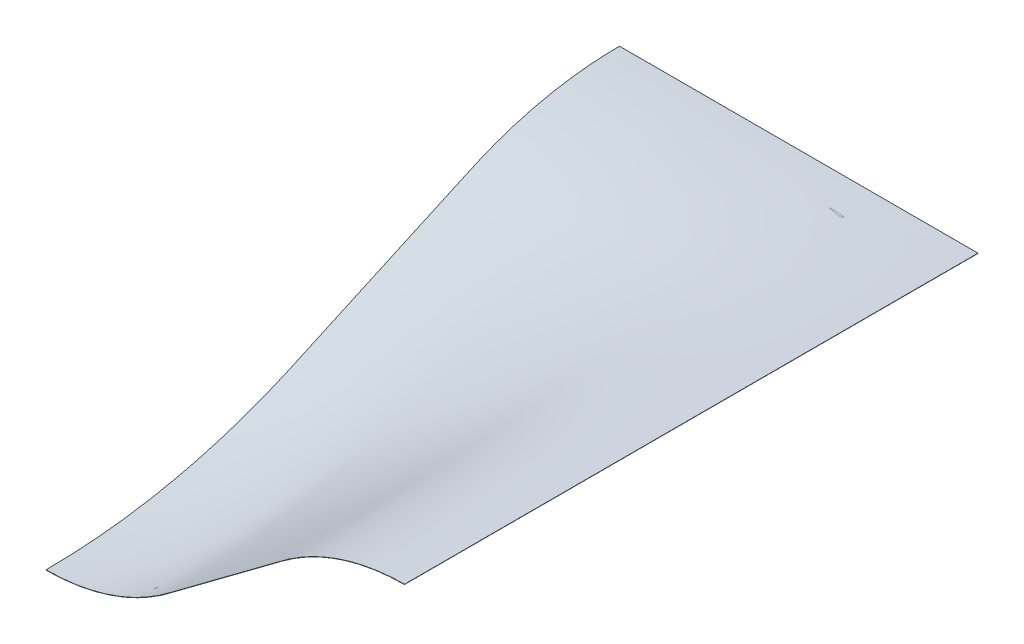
ISO-10303-21;
HEADER;
FILE_DESCRIPTION(('STEP AP214'),'2;1');
FILE_NAME('part.step','',(''),(''),'','','');
FILE_SCHEMA(('AUTOMOTIVE_DESIGN { 1 0 10303 214 1 1 1 1 }'));
ENDSEC;
DATA;
#1=APPLICATION_CONTEXT('core data for automotive mechanical design processes');
#2=APPLICATION_PROTOCOL_DEFINITION('international standard','automotive_design',2000,#1);
#3=PRODUCT_CONTEXT('',#1,'mechanical');
#4=PRODUCT('Part','Part','',(#3));
#5=PRODUCT_RELATED_PRODUCT_CATEGORY('part','',(#4));
#6=PRODUCT_DEFINITION_FORMATION('','',#4);
#7=PRODUCT_DEFINITION_CONTEXT('part definition',#1,'design');
#8=PRODUCT_DEFINITION('design','',#6,#7);
#9=PRODUCT_DEFINITION_SHAPE('','',#8);
#10=(LENGTH_UNIT() NAMED_UNIT(*) SI_UNIT(.MILLI.,.METRE.));
#11=(NAMED_UNIT(*) PLANE_ANGLE_UNIT() SI_UNIT($,.RADIAN.));
#12=(NAMED_UNIT(*) SI_UNIT($,.STERADIAN.) SOLID_ANGLE_UNIT());
#13=UNCERTAINTY_MEASURE_WITH_UNIT(LENGTH_MEASURE(1.E-05),#10,'distance_accuracy_value','');
#14=(GEOMETRIC_REPRESENTATION_CONTEXT(3) GLOBAL_UNCERTAINTY_ASSIGNED_CONTEXT((#13)) GLOBAL_UNIT_ASSIGNED_CONTEXT((#10,
#11,#12)) REPRESENTATION_CONTEXT('',''));
#15=CARTESIAN_POINT('',(0.,0.,0.));
#16=DIRECTION('',(0.,0.,1.));
#17=DIRECTION('',(1.,0.,0.));
#18=AXIS2_PLACEMENT_3D('',#15,#16,#17);
#19=CARTESIAN_POINT('',(0.,-2.,-4800.));
#20=DIRECTION('',(0.,0.,-1.));
#21=DIRECTION('',(1.,0.,0.));
#22=AXIS2_PLACEMENT_3D('',#19,#20,#21);
#23=PLANE('',#22);
#24=CARTESIAN_POINT('',(0.,0.,-4800.));
#25=CARTESIAN_POINT('',(0.,-2.,-4800.));
#26=B_SPLINE_CURVE_WITH_KNOTS('',1,(#24,#25),.UNSPECIFIED.,.F.,.F.,(2,2),(0.,1.),.UNSPECIFIED.);
#27=CARTESIAN_POINT('',(0.,0.,-4800.));
#28=VERTEX_POINT('',#27);
#29=CARTESIAN_POINT('',(0.,-2.,-4800.));
#30=VERTEX_POINT('',#29);
#31=EDGE_CURVE('E13',#28,#30,#26,.T.);
#32=ORIENTED_EDGE('',*,*,#31,.F.);
#33=CARTESIAN_POINT('',(3000.,0.,-4800.));
#34=CARTESIAN_POINT('',(2959.98043379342,0.,-4800.));
#35=CARTESIAN_POINT('',(2879.94130290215,0.,-4800.));
#36=CARTESIAN_POINT('',(2759.85737199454,0.,-4799.99999999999));
#37=CARTESIAN_POINT('',(2639.72296737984,0.,-4800.));
#38=CARTESIAN_POINT('',(2519.51263633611,0.,-4800.));
#39=CARTESIAN_POINT('',(2399.20092614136,0.,-4800.));
#40=CARTESIAN_POINT('',(2278.76196458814,0.,-4800.));
#41=CARTESIAN_POINT('',(2158.16987946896,0.,-4800.));
#42=CARTESIAN_POINT('',(2077.65536997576,0.,-4800.));
#43=CARTESIAN_POINT('',(1947.93143691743,0.,-4800.));
#44=CARTESIAN_POINT('',(1768.52503826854,0.,-4800.));
#45=CARTESIAN_POINT('',(1498.58943272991,0.,-4800.));
#46=CARTESIAN_POINT('',(1228.6533962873,0.,-4800.));
#47=CARTESIAN_POINT('',(1049.24614447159,0.,-4800.));
#48=CARTESIAN_POINT('',(919.639554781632,0.,-4800.));
#49=CARTESIAN_POINT('',(839.360749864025,0.,-4800.));
#50=CARTESIAN_POINT('',(719.121945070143,0.,-4800.));
#51=CARTESIAN_POINT('',(599.03602694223,0.,-4800.));
#52=CARTESIAN_POINT('',(479.077162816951,0.,-4800.));
#53=CARTESIAN_POINT('',(359.219520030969,0.,-4800.));
#54=CARTESIAN_POINT('',(239.437685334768,0.,-4800.));
#55=CARTESIAN_POINT('',(119.706245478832,0.,-4800.));
#56=CARTESIAN_POINT('',(39.9020823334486,0.,-4800.));
#57=CARTESIAN_POINT('',(0.,0.,-4800.));
#58=B_SPLINE_CURVE_WITH_KNOTS('',3,(#33,#34,#35,#36,#37,#38,#39,#40,#41,#42,#43,#44,#45,#46,#47,
#48,#49,#50,#51,#52,#53,#54,#55,#56,#57),.UNSPECIFIED.,.F.,.F.,(4,1,1,1,1,1,1,1,2,1,1,1,2,1,1,1,
1,1,1,1,4),(0.,0.0402332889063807,0.0804665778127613,0.120699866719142,0.160933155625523,
0.201166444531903,0.241399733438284,0.281633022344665,0.321866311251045,0.411169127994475,
0.500471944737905,0.589774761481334,0.679077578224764,0.719192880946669,0.759308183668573,
0.799423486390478,0.839538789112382,0.879654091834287,0.919769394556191,0.959884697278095,1.),.UNSPECIFIED.);
#59=CARTESIAN_POINT('',(3000.,0.,-4800.));
#60=VERTEX_POINT('',#59);
#61=EDGE_CURVE('E271',#28,#60,#58,.F.);
#62=ORIENTED_EDGE('',*,*,#61,.T.);
#63=CARTESIAN_POINT('',(3000.,0.,-4800.));
#64=DIRECTION('',(0.,-1.,0.));
#65=VECTOR('',#64,1.);
#66=LINE('',#63,#65);
#67=CARTESIAN_POINT('',(3000.,-2.,-4800.));
#68=VERTEX_POINT('',#67);
#69=EDGE_CURVE('E128',#60,#68,#66,.T.);
#70=ORIENTED_EDGE('',*,*,#69,.T.);
#71=CARTESIAN_POINT('',(0.,-2.,-4800.));
#72=CARTESIAN_POINT('',(124.377967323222,-2.,-4800.));
#73=CARTESIAN_POINT('',(248.755934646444,-2.,-4800.));
#74=CARTESIAN_POINT('',(497.767120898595,-2.,-4800.));
#75=CARTESIAN_POINT('',(622.400339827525,-2.,-4800.));
#76=CARTESIAN_POINT('',(872.205886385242,-2.,-4800.));
#77=CARTESIAN_POINT('',(997.378214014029,-2.,-4800.));
#78=CARTESIAN_POINT('',(1248.3723308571,-2.,-4800.));
#79=CARTESIAN_POINT('',(1374.19412007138,-2.,-4800.));
#80=CARTESIAN_POINT('',(1625.83457711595,-2.,-4800.));
#81=CARTESIAN_POINT('',(1751.65324494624,-2.,-4800.));
#82=CARTESIAN_POINT('',(2002.63844450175,-2.,-4800.));
#83=CARTESIAN_POINT('',(2127.80497622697,-2.,-4800.));
#84=CARTESIAN_POINT('',(2377.60295642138,-2.,-4800.));
#85=CARTESIAN_POINT('',(2502.23440489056,-2.,-4800.));
#86=CARTESIAN_POINT('',(2751.24390223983,-2.,-4800.));
#87=CARTESIAN_POINT('',(2875.62195111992,-2.,-4800.));
#88=CARTESIAN_POINT('',(3000.,-2.,-4800.));
#89=B_SPLINE_CURVE_WITH_KNOTS('',3,(#71,#72,#73,#74,#75,#76,#77,#78,#79,#80,#81,#82,#83,#84,#85,
#86,#87,#88),.UNSPECIFIED.,.F.,.F.,(4,2,2,2,2,2,2,2,4),(0.,373.133901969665,747.033558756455,
1122.55054164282,1500.01590928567,1877.47191277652,2252.9715079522,2626.86585335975,3000.),.UNSPECIFIED.);
#90=EDGE_CURVE('E182',#30,#68,#89,.T.);
#91=ORIENTED_EDGE('',*,*,#90,.F.);
#92=EDGE_LOOP('',(#32,#62,#70,#91));
#93=FACE_BOUND('',#92,.T.);
#94=ADVANCED_FACE('F115',(#93),#23,.T.);
#95=CARTESIAN_POINT('',(3000.,-2.00000000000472,-4800.));
#96=DIRECTION('',(1.,0.,0.));
#97=DIRECTION('',(0.,0.,1.));
#98=AXIS2_PLACEMENT_3D('',#95,#96,#97);
#99=PLANE('',#98);
#100=ORIENTED_EDGE('',*,*,#69,.F.);
#101=CARTESIAN_POINT('',(3000.,1.33226762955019E-12,0.));
#102=CARTESIAN_POINT('',(3000.,0.,-677.475873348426));
#103=CARTESIAN_POINT('',(3000.00000000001,0.,-1354.95174669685));
#104=CARTESIAN_POINT('',(3000.,0.,-2548.4662226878));
#105=CARTESIAN_POINT('',(3000.00000000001,0.,-3064.50482533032));
#106=CARTESIAN_POINT('',(2999.99999999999,0.,-3987.02895198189));
#107=CARTESIAN_POINT('',(3000.,0.,-4393.51447599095));
#108=CARTESIAN_POINT('',(3000.,0.,-4800.));
#109=B_SPLINE_CURVE_WITH_KNOTS('',3,(#101,#102,#103,#104,#105,#106,#107,#108),.UNSPECIFIED.,.F.,
.F.,(4,2,2,4),(0.,0.423422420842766,0.745946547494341,1.),.UNSPECIFIED.);
#110=CARTESIAN_POINT('',(3000.,1.33226762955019E-12,0.));
#111=VERTEX_POINT('',#110);
#112=EDGE_CURVE('E164',#60,#111,#109,.F.);
#113=ORIENTED_EDGE('',*,*,#112,.T.);
#114=CARTESIAN_POINT('',(3000.,1.33226762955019E-12,0.));
#115=DIRECTION('',(0.,-1.,0.));
#116=VECTOR('',#115,1.);
#117=LINE('',#114,#116);
#118=CARTESIAN_POINT('',(3000.,-1.99999999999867,0.));
#119=VERTEX_POINT('',#118);
#120=EDGE_CURVE('E158',#111,#119,#117,.T.);
#121=ORIENTED_EDGE('',*,*,#120,.T.);
#122=CARTESIAN_POINT('',(3000.,-2.,-4800.));
#123=CARTESIAN_POINT('',(3000.,-2.,-4600.));
#124=CARTESIAN_POINT('',(3000.,-2.,-4400.));
#125=CARTESIAN_POINT('',(3000.,-2.,-4000.));
#126=CARTESIAN_POINT('',(3000.,-2.,-3800.));
#127=CARTESIAN_POINT('',(3000.,-2.,-3400.));
#128=CARTESIAN_POINT('',(3000.,-2.,-3200.));
#129=CARTESIAN_POINT('',(3000.,-2.,-2800.));
#130=CARTESIAN_POINT('',(3000.,-2.,-2600.));
#131=CARTESIAN_POINT('',(3000.,-2.,-2200.));
#132=CARTESIAN_POINT('',(3000.,-2.,-2000.));
#133=CARTESIAN_POINT('',(3000.,-1.99999999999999,-1600.));
#134=CARTESIAN_POINT('',(3000.00000000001,-1.99999999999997,-1400.));
#135=CARTESIAN_POINT('',(3000.,-1.99999999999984,-999.999999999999));
#136=CARTESIAN_POINT('',(3000.,-1.99999999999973,-800.));
#137=CARTESIAN_POINT('',(3000.,-1.99999999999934,-400.));
#138=CARTESIAN_POINT('',(3000.,-1.99999999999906,-200.));
#139=CARTESIAN_POINT('',(3000.,-1.99999999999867,0.));
#140=B_SPLINE_CURVE_WITH_KNOTS('',3,(#122,#123,#124,#125,#126,#127,#128,#129,#130,#131,#132,
#133,#134,#135,#136,#137,#138,#139),.UNSPECIFIED.,.F.,.F.,(4,2,2,2,2,2,2,2,4),(0.,
600.000000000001,1200.,1800.,2400.,3000.,3600.,4200.,4800.),.UNSPECIFIED.);
#141=EDGE_CURVE('E162',#68,#119,#140,.T.);
#142=ORIENTED_EDGE('',*,*,#141,.F.);
#143=EDGE_LOOP('',(#100,#113,#121,#142));
#144=FACE_BOUND('',#143,.T.);
#145=ADVANCED_FACE('F161',(#144),#99,.T.);
#146=CARTESIAN_POINT('',(3000.,-1.99999999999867,0.));
#147=DIRECTION('',(0.,0.,1.));
#148=DIRECTION('',(0.,1.,0.));
#149=AXIS2_PLACEMENT_3D('',#146,#147,#148);
#150=PLANE('',#149);
#151=ORIENTED_EDGE('',*,*,#120,.F.);
#152=CARTESIAN_POINT('',(3.11917539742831E-13,-1395.,0.));
#153=CARTESIAN_POINT('',(45.506389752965,-1395.,0.));
#154=CARTESIAN_POINT('',(136.519482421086,-1391.34356531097,0.));
#155=CARTESIAN_POINT('',(272.131026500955,-1374.92838689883,0.));
#156=CARTESIAN_POINT('',(405.932833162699,-1347.70289906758,0.));
#157=CARTESIAN_POINT('',(537.038405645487,-1309.864911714,0.));
#158=CARTESIAN_POINT('',(664.583761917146,-1261.68939362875,0.));
#159=CARTESIAN_POINT('',(787.734317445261,-1203.52483949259,0.));
#160=CARTESIAN_POINT('',(905.692101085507,-1135.79068289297,0.));
#161=CARTESIAN_POINT('',(980.364751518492,-1084.57832466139,0.));
#162=CARTESIAN_POINT('',(1097.23903694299,-997.378955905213,0.));
#163=CARTESIAN_POINT('',(1258.03767588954,-877.407828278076,0.));
#164=CARTESIAN_POINT('',(1498.50419573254,-697.996859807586,0.));
#165=CARTESIAN_POINT('',(1738.97108796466,-518.585613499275,0.));
#166=CARTESIAN_POINT('',(1899.77047900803,-398.613924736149,0.));
#167=CARTESIAN_POINT('',(2016.75205157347,-311.334509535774,0.));
#168=CARTESIAN_POINT('',(2091.64472728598,-259.971284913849,0.));
#169=CARTESIAN_POINT('',(2209.94985071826,-192.03777416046,0.));
#170=CARTESIAN_POINT('',(2333.46281917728,-133.702168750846,0.));
#171=CARTESIAN_POINT('',(2461.38332376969,-85.385071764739,0.));
#172=CARTESIAN_POINT('',(2592.87434748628,-47.4359467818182,0.));
#173=CARTESIAN_POINT('',(2727.069400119,-20.1305254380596,0.));
#174=CARTESIAN_POINT('',(2863.07941891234,-3.66716561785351,0.));
#175=CARTESIAN_POINT('',(2954.35991067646,1.34065157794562E-12,0.));
#176=CARTESIAN_POINT('',(3000.,1.33226762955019E-12,0.));
#177=B_SPLINE_CURVE_WITH_KNOTS('',3,(#152,#153,#154,#155,#156,#157,#158,#159,#160,#161,#162,
#163,#164,#165,#166,#167,#168,#169,#170,#171,#172,#173,#174,#175,#176),.UNSPECIFIED.,.F.,.F.,(4,
1,1,1,1,1,1,1,2,1,1,1,2,1,1,1,1,1,1,1,4),(0.,0.0401153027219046,0.080230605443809,
0.120345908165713,0.160461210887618,0.200576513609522,0.240691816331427,0.280807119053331,
0.320922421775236,0.410225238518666,0.499528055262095,0.588830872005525,0.678133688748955,
0.718366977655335,0.758600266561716,0.798833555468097,0.839066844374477,0.879300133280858,
0.919533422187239,0.959766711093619,1.),.UNSPECIFIED.);
#178=CARTESIAN_POINT('',(3.11917539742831E-13,-1395.,0.));
#179=VERTEX_POINT('',#178);
#180=EDGE_CURVE('E185',#111,#179,#177,.F.);
#181=ORIENTED_EDGE('',*,*,#180,.T.);
#182=CARTESIAN_POINT('',(3.02158707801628E-13,-1397.,0.));
#183=CARTESIAN_POINT('',(3.11917539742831E-13,-1395.,0.));
#184=B_SPLINE_CURVE_WITH_KNOTS('',1,(#182,#183),.UNSPECIFIED.,.F.,.F.,(2,2),(0.,1.),.UNSPECIFIED.);
#185=CARTESIAN_POINT('',(3.02158709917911E-13,-1397.,-2.53229084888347E-06));
#186=VERTEX_POINT('',#185);
#187=EDGE_CURVE('E172',#179,#186,#184,.F.);
#188=ORIENTED_EDGE('',*,*,#187,.T.);
#189=CARTESIAN_POINT('',(3000.,-1.99999999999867,0.));
#190=CARTESIAN_POINT('',(2982.29607580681,-2.00004771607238,9.13525288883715E-12));
#191=CARTESIAN_POINT('',(2964.59215546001,-2.27623879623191,1.18027998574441E-11));
#192=CARTESIAN_POINT('',(2929.2020414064,-3.38032475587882,1.13677450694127E-11));
#193=CARTESIAN_POINT('',(2911.51584719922,-4.20820359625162,8.26531105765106E-12));
#194=CARTESIAN_POINT('',(2876.17898402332,-6.41501283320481,3.4475414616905E-12));
#195=CARTESIAN_POINT('',(2858.52831289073,-7.79390857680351,1.73211867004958E-12));
#196=CARTESIAN_POINT('',(2823.28021112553,-11.1013778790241,1.62723746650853E-11));
#197=CARTESIAN_POINT('',(2805.68277568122,-13.0299001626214,3.25263774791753E-11));
#198=CARTESIAN_POINT('',(2770.55876885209,-17.4340832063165,3.79600950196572E-11));
#199=CARTESIAN_POINT('',(2753.03218877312,-19.9096746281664,2.71432390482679E-11));
#200=CARTESIAN_POINT('',(2718.06755136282,-25.4058269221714,3.31630868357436E-11));
#201=CARTESIAN_POINT('',(2700.62948034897,-28.426300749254,4.9995377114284E-11));
#202=CARTESIAN_POINT('',(2665.85923548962,-35.0085068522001,5.74767730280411E-11));
#203=CARTESIAN_POINT('',(2648.52704211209,-38.5701359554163,4.81308636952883E-11));
#204=CARTESIAN_POINT('',(2613.98591700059,-46.2308447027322,3.47797091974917E-11));
#205=CARTESIAN_POINT('',(2596.77695847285,-50.3298035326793,3.07732657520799E-11));
#206=CARTESIAN_POINT('',(2562.4995365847,-59.0609800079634,2.04712963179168E-11));
#207=CARTESIAN_POINT('',(2545.43103848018,-63.6930612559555,1.41763549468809E-11));
#208=CARTESIAN_POINT('',(2511.45139867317,-73.4849195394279,3.70126211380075E-11));
#209=CARTESIAN_POINT('',(2494.54021314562,-78.6445444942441,6.6133645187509E-11));
#210=CARTESIAN_POINT('',(2460.89216663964,-89.4863272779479,4.72411807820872E-11));
#211=CARTESIAN_POINT('',(2444.15525145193,-95.1683168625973,-7.47553496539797E-13));
#212=CARTESIAN_POINT('',(2410.87223002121,-107.048393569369,6.18494955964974E-12));
#213=CARTESIAN_POINT('',(2394.32605886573,-113.24629883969,6.10700711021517E-11));
#214=CARTESIAN_POINT('',(2361.44084696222,-126.151345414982,9.00183454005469E-11));
#215=CARTESIAN_POINT('',(2345.10172901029,-132.858289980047,6.41125696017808E-11));
#216=CARTESIAN_POINT('',(2312.64689337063,-146.774521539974,8.14446605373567E-11));
#217=CARTESIAN_POINT('',(2296.53108557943,-153.983598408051,1.24653769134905E-10));
#218=CARTESIAN_POINT('',(2264.53841732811,-168.895778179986,1.0933492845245E-10));
#219=CARTESIAN_POINT('',(2248.66145336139,-176.598658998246,5.08524095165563E-11));
#220=CARTESIAN_POINT('',(2217.162275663,-192.490366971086,5.28664392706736E-11));
#221=CARTESIAN_POINT('',(2201.53994326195,-200.678958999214,1.13305867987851E-10));
#222=CARTESIAN_POINT('',(2170.56483141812,-217.533388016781,7.31611116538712E-11));
#223=CARTESIAN_POINT('',(2155.21191859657,-226.198979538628,-2.73409860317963E-11));
#224=CARTESIAN_POINT('',(2132.39340965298,-239.549457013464,4.34999822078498E-11));
#225=CARTESIAN_POINT('',(2124.82377392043,-244.057425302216,1.04014092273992E-10));
#226=CARTESIAN_POINT('',(2109.75742219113,-253.18905451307,1.16620459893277E-10));
#227=CARTESIAN_POINT('',(2102.26068637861,-257.812682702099,6.87430577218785E-11));
#228=CARTESIAN_POINT('',(2087.34202795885,-267.174427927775,6.82270050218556E-11));
#229=CARTESIAN_POINT('',(2079.92008445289,-271.912511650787,1.15560964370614E-10));
#230=CARTESIAN_POINT('',(2068.84383427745,-279.104985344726,1.21682253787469E-10));
#231=CARTESIAN_POINT('',(2065.1615827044,-281.516440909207,1.12913778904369E-10));
#232=CARTESIAN_POINT('',(2057.81642439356,-286.367471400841,1.09316352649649E-10));
#233=CARTESIAN_POINT('',(2054.15351485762,-288.807042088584,1.14485326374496E-10));
#234=CARTESIAN_POINT('',(2046.84726697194,-293.714128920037,1.09988026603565E-10));
#235=CARTESIAN_POINT('',(2043.20392575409,-296.181640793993,1.00323990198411E-10));
#236=CARTESIAN_POINT('',(2035.93702928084,-301.144443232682,1.45380656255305E-10));
#237=CARTESIAN_POINT('',(2032.31347108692,-303.639729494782,2.00091519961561E-10));
#238=CARTESIAN_POINT('',(2025.08635257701,-308.657915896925,1.52732846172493E-10));
#239=CARTESIAN_POINT('',(2021.4827892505,-311.180811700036,5.06875908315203E-11));
#240=CARTESIAN_POINT('',(2016.09240341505,-314.985883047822,6.83707249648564E-11));
#241=CARTESIAN_POINT('',(2014.29820463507,-316.257620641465,1.02716684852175E-10));
#242=CARTESIAN_POINT('',(2010.71488802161,-318.807934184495,1.29483983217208E-10));
#243=CARTESIAN_POINT('',(2008.9257697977,-320.086509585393,1.21908635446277E-10));
#244=CARTESIAN_POINT('',(2003.56629379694,-323.932315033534,1.06119472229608E-10));
#245=CARTESIAN_POINT('',(2000.00337802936,-326.509932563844,1.04839010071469E-10));
#246=CARTESIAN_POINT('',(1994.67427063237,-330.39681271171,9.74470113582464E-11));
#247=CARTESIAN_POINT('',(1992.90055086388,-331.695770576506,9.40714907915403E-11));
#248=CARTESIAN_POINT('',(1989.35833201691,-334.300488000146,1.06489530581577E-10));
#249=CARTESIAN_POINT('',(1987.58983252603,-335.606246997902,1.22281533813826E-10));
#250=CARTESIAN_POINT('',(1984.94084711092,-337.569847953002,1.30919710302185E-10));
#251=CARTESIAN_POINT('',(1984.05850604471,-338.225188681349,1.31291015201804E-10));
#252=CARTESIAN_POINT('',(1982.29488376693,-339.538098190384,1.25296247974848E-10));
#253=CARTESIAN_POINT('',(1981.4136031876,-340.195667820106,1.18927229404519E-10));
#254=CARTESIAN_POINT('',(1979.65045518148,-341.511181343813,1.1952540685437E-10));
#255=CARTESIAN_POINT('',(1978.76858773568,-342.169125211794,1.265010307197E-10));
#256=CARTESIAN_POINT('',(1977.00491957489,-343.484979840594,1.30370890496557E-10));
#257=CARTESIAN_POINT('',(1976.12311885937,-344.142890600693,1.27265799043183E-10));
#258=CARTESIAN_POINT('',(1973.47788975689,-346.116489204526,1.03116667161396E-10));
#259=CARTESIAN_POINT('',(1971.71445920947,-347.432174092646,6.72410997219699E-11));
#260=CARTESIAN_POINT('',(1968.18783103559,-350.063373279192,6.11779626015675E-11));
#261=CARTESIAN_POINT('',(1966.42463340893,-351.378887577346,9.09817734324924E-11));
#262=CARTESIAN_POINT('',(1961.13572380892,-355.324919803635,1.48403351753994E-10));
#263=CARTESIAN_POINT('',(1957.61001142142,-357.955437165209,1.44055221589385E-10));
#264=CARTESIAN_POINT('',(1950.55948096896,-363.215805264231,1.12715195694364E-10));
#265=CARTESIAN_POINT('',(1947.03466290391,-365.845656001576,8.57290420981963E-11));
#266=CARTESIAN_POINT('',(1939.98589964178,-371.104706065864,1.16015404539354E-10));
#267=CARTESIAN_POINT('',(1936.46195444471,-373.733905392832,1.73267054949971E-10));
#268=CARTESIAN_POINT('',(1929.41491593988,-378.991668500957,1.75192446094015E-10));
#269=CARTESIAN_POINT('',(1925.89182263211,-381.620232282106,1.19893397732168E-10));
#270=CARTESIAN_POINT('',(1918.84646679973,-386.876739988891,8.17813870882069E-11));
#271=CARTESIAN_POINT('',(1915.32420427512,-389.504683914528,9.89513347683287E-11));
#272=CARTESIAN_POINT('',(1908.28048893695,-394.759967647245,1.02678602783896E-10));
#273=CARTESIAN_POINT('',(1904.75903612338,-397.387307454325,8.92429595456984E-11));
#274=CARTESIAN_POINT('',(1894.19702249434,-405.267577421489,6.91202041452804E-11));
#275=CARTESIAN_POINT('',(1887.15646167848,-410.520507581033,8.2594885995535E-11));
#276=CARTESIAN_POINT('',(1866.04356826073,-426.272740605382,1.09894293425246E-10));
#277=CARTESIAN_POINT('',(1851.97123565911,-436.772043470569,1.10627564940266E-10));
#278=CARTESIAN_POINT('',(1809.78467222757,-468.24724511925,8.11967519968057E-11));
#279=CARTESIAN_POINT('',(1781.67044139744,-489.223143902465,1.94720303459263E-11));
#280=CARTESIAN_POINT('',(1725.47359896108,-531.151350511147,-8.26971238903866E-13));
#281=CARTESIAN_POINT('',(1697.39098735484,-552.103658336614,4.04828167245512E-11));
#282=CARTESIAN_POINT('',(1613.19593690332,-614.921199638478,8.37940150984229E-11));
#283=CARTESIAN_POINT('',(1557.08349805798,-656.786433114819,5.40629108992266E-12));
#284=CARTESIAN_POINT('',(1472.92032588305,-719.580190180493,6.54262345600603E-11));
#285=CARTESIAN_POINT('',(1444.86959255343,-740.508713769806,1.15019605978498E-10));
#286=CARTESIAN_POINT('',(1388.75784616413,-782.373430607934,1.2046516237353E-10));
#287=CARTESIAN_POINT('',(1360.69683310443,-803.309623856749,7.62829874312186E-11));
#288=CARTESIAN_POINT('',(1304.55407434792,-845.197478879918,5.03394112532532E-11));
#289=CARTESIAN_POINT('',(1276.47232865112,-866.149140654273,6.86241531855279E-11));
#290=CARTESIAN_POINT('',(1220.27757119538,-908.075791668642,5.76405408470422E-11));
#291=CARTESIAN_POINT('',(1192.16455943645,-929.050780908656,2.83192185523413E-11));
#292=CARTESIAN_POINT('',(1157.01715059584,-955.274101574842,1.54488088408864E-11));
#293=CARTESIAN_POINT('',(1149.98275351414,-960.522433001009,1.40641817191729E-11));
#294=CARTESIAN_POINT('',(1135.91116444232,-971.021181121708,2.25216346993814E-11));
#295=CARTESIAN_POINT('',(1128.8739724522,-976.271597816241,3.23681756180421E-11));
#296=CARTESIAN_POINT('',(1114.79662493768,-986.774642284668,3.96202997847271E-11));
#297=CARTESIAN_POINT('',(1107.7564694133,-992.027270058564,3.70206420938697E-11));
#298=CARTESIAN_POINT('',(1097.19507210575,-999.907080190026,3.54373133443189E-11));
#299=CARTESIAN_POINT('',(1093.6738303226,-1002.53426254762,3.52957315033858E-11));
#300=CARTESIAN_POINT('',(1086.63054263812,-1007.78922721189,3.660642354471E-11));
#301=CARTESIAN_POINT('',(1083.10849673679,-1010.41700951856,3.80590614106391E-11));
#302=CARTESIAN_POINT('',(1076.0635797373,-1015.67318980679,3.3813955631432E-11));
#303=CARTESIAN_POINT('',(1072.54070863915,-1018.30158778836,2.81145366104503E-11));
#304=CARTESIAN_POINT('',(1065.49412016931,-1023.55901515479,4.373228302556E-11));
#305=CARTESIAN_POINT('',(1061.97040279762,-1026.18804453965,6.50559387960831E-11));
#306=CARTESIAN_POINT('',(1054.92210069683,-1031.44675043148,6.03415933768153E-11));
#307=CARTESIAN_POINT('',(1051.39751596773,-1034.07642693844,3.42919329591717E-11));
#308=CARTESIAN_POINT('',(1046.11030704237,-1038.02118930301,3.66948751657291E-11));
#309=CARTESIAN_POINT('',(1044.34768283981,-1039.33627515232,4.44114404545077E-11));
#310=CARTESIAN_POINT('',(1040.82220966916,-1041.96661450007,2.73606803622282E-11));
#311=CARTESIAN_POINT('',(1039.05936070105,-1043.28186799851,2.58921301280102E-12));
#312=CARTESIAN_POINT('',(1035.53343547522,-1045.91254475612,-2.58954697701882E-12));
#313=CARTESIAN_POINT('',(1033.7703592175,-1047.22796801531,1.7008883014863E-11));
#314=CARTESIAN_POINT('',(1030.24397636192,-1049.85898571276,5.47379813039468E-11));
#315=CARTESIAN_POINT('',(1028.48066976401,-1051.17458015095,7.28684577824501E-11));
#316=CARTESIAN_POINT('',(1025.83562370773,-1053.14803798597,5.75008077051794E-11));
#317=CARTESIAN_POINT('',(1024.95388379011,-1053.80590077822,4.52827092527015E-11));
#318=CARTESIAN_POINT('',(1023.19034379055,-1055.12166779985,2.64394297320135E-11));
#319=CARTESIAN_POINT('',(1022.30854370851,-1055.77957202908,1.98146197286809E-11));
#320=CARTESIAN_POINT('',(1020.54489111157,-1057.0954327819,5.190199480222E-11));
#321=CARTESIAN_POINT('',(1019.66303859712,-1057.75338930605,9.06172041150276E-11));
#322=CARTESIAN_POINT('',(1017.89860674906,-1059.06979536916,1.06306940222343E-10));
#323=CARTESIAN_POINT('',(1017.01602739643,-1059.72824488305,8.3232228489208E-11));
#324=CARTESIAN_POINT('',(1014.36528617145,-1061.70142133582,2.12768774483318E-11));
#325=CARTESIAN_POINT('',(1012.59500929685,-1063.01330911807,-1.03043454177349E-11));
#326=CARTESIAN_POINT('',(1009.04936821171,-1065.63049187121,1.03051852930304E-11));
#327=CARTESIAN_POINT('',(1007.27400359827,-1066.93578629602,6.25027670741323E-11));
#328=CARTESIAN_POINT('',(1003.71803526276,-1069.53952338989,8.17973688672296E-11));
#329=CARTESIAN_POINT('',(1001.937431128,-1070.83796549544,4.88874960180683E-11));
#330=CARTESIAN_POINT('',(998.371058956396,-1073.42804054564,2.34512392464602E-11));
#331=CARTESIAN_POINT('',(996.585290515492,-1074.71967293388,3.09281055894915E-11));
#332=CARTESIAN_POINT('',(993.008603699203,-1077.29609064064,4.16009813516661E-11));
#333=CARTESIAN_POINT('',(991.217684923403,-1078.58087540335,4.47966483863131E-11));
#334=CARTESIAN_POINT('',(987.630729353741,-1081.14358038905,2.79190676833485E-11));
#335=CARTESIAN_POINT('',(985.834692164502,-1082.42150005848,7.84397094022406E-12));
#336=CARTESIAN_POINT('',(980.438730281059,-1086.24507968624,-1.56897664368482E-11));
#337=CARTESIAN_POINT('',(976.831371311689,-1088.78026057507,1.75563511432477E-11));
#338=CARTESIAN_POINT('',(969.596505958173,-1093.82290987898,5.57191892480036E-11));
#339=CARTESIAN_POINT('',(965.968996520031,-1096.33037391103,6.06314913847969E-11));
#340=CARTESIAN_POINT('',(958.694042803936,-1101.31742382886,6.34855455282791E-11));
#341=CARTESIAN_POINT('',(955.046595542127,-1103.79700536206,6.14262239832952E-11));
#342=CARTESIAN_POINT('',(947.731982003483,-1108.72812254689,6.24572818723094E-11));
#343=CARTESIAN_POINT('',(944.064812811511,-1111.17965387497,6.55484446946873E-11));
#344=CARTESIAN_POINT('',(936.710983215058,-1116.05449500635,5.85142215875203E-11));
#345=CARTESIAN_POINT('',(933.024319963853,-1118.47780051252,4.83868491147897E-11));
#346=CARTESIAN_POINT('',(921.934596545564,-1125.70566827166,1.52794093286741E-11));
#347=CARTESIAN_POINT('',(914.503372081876,-1130.46712377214,-1.04228032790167E-11));
#348=CARTESIAN_POINT('',(899.565580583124,-1139.87513224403,1.04258234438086E-11));
#349=CARTESIAN_POINT('',(892.058992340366,-1144.52165152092,5.69976013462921E-11));
#350=CARTESIAN_POINT('',(876.972296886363,-1153.6986094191,9.51395214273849E-11));
#351=CARTESIAN_POINT('',(869.392169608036,-1158.22901505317,8.66942036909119E-11));
#352=CARTESIAN_POINT('',(854.160242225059,-1167.17255506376,6.67403859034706E-11));
#353=CARTESIAN_POINT('',(846.508423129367,-1171.58565710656,5.52310507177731E-11));
#354=CARTESIAN_POINT('',(831.135067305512,-1180.29335753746,4.40274103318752E-11));
#355=CARTESIAN_POINT('',(823.413512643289,-1184.58792421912,4.43362362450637E-11));
#356=CARTESIAN_POINT('',(800.144044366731,-1197.29363918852,6.02146718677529E-11));
#357=CARTESIAN_POINT('',(784.496694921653,-1205.52365016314,9.07465527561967E-11));
#358=CARTESIAN_POINT('',(752.945818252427,-1221.49578373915,1.0761567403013E-10));
#359=CARTESIAN_POINT('',(737.042170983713,-1229.23766885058,9.39315684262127E-11));
#360=CARTESIAN_POINT('',(704.994113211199,-1244.22564884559,6.65575875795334E-11));
#361=CARTESIAN_POINT('',(688.849597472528,-1251.47151880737,5.28677125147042E-11));
#362=CARTESIAN_POINT('',(656.335564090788,-1265.4589739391,4.58875144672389E-11));
#363=CARTESIAN_POINT('',(639.965954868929,-1272.20034621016,5.26057545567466E-11));
#364=CARTESIAN_POINT('',(607.018081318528,-1285.17178242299,1.11858822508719E-10));
#365=CARTESIAN_POINT('',(590.43973879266,-1291.40164774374,1.64411356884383E-10));
#366=CARTESIAN_POINT('',(557.090810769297,-1303.34315361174,1.82881231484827E-10));
#367=CARTESIAN_POINT('',(540.320159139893,-1309.05460947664,1.48767821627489E-10));
#368=CARTESIAN_POINT('',(506.603224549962,-1319.95271702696,1.02935329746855E-10));
#369=CARTESIAN_POINT('',(489.65688668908,-1325.13919885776,9.12234739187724E-11));
#370=CARTESIAN_POINT('',(455.605651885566,-1334.98212013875,7.80309098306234E-11));
#371=CARTESIAN_POINT('',(438.500710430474,-1339.63840559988,7.65531665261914E-11));
#372=CARTESIAN_POINT('',(404.149234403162,-1348.41529535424,9.40026960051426E-11));
#373=CARTESIAN_POINT('',(386.902664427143,-1352.53576108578,1.12935235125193E-10));
#374=CARTESIAN_POINT('',(352.285318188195,-1360.23670321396,7.78580923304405E-11));
#375=CARTESIAN_POINT('',(334.914514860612,-1363.81705794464,2.38320028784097E-11));
#376=CARTESIAN_POINT('',(300.066159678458,-1370.43392482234,-1.56382584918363E-11));
#377=CARTESIAN_POINT('',(282.588587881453,-1373.47033194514,-1.06920099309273E-12));
#378=CARTESIAN_POINT('',(247.544224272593,-1378.99550094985,7.9097054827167E-12));
#379=CARTESIAN_POINT('',(229.977418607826,-1381.4841749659,2.31632255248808E-12));
#380=CARTESIAN_POINT('',(194.772378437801,-1385.91164688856,4.22310167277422E-13));
#381=CARTESIAN_POINT('',(177.134135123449,-1387.8503747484,4.12286389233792E-12));
#382=CARTESIAN_POINT('',(141.803955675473,-1391.17536379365,-3.09529074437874E-12));
#383=CARTESIAN_POINT('',(124.112014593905,-1392.56157240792,-1.40153898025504E-11));
#384=CARTESIAN_POINT('',(88.6923395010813,-1394.78008438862,1.50446712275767E-11));
#385=CARTESIAN_POINT('',(70.9646033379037,-1395.61235339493,5.5027988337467E-11));
#386=CARTESIAN_POINT('',(35.4912463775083,-1396.72229532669,1.20513950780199E-10));
#387=CARTESIAN_POINT('',(17.7456250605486,-1396.99995164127,1.46016162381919E-10));
#388=CARTESIAN_POINT('',(3.11917539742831E-13,-1397.,1.31580514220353E-10));
#389=B_SPLINE_CURVE_WITH_KNOTS('',3,(#189,#190,#191,#192,#193,#194,#195,#196,#197,#198,#199,
#200,#201,#202,#203,#204,#205,#206,#207,#208,#209,#210,#211,#212,#213,#214,#215,#216,#217,#218,
#219,#220,#221,#222,#223,#224,#225,#226,#227,#228,#229,#230,#231,#232,#233,#234,#235,#236,#237,
#238,#239,#240,#241,#242,#243,#244,#245,#246,#247,#248,#249,#250,#251,#252,#253,#254,#255,#256,
#257,#258,#259,#260,#261,#262,#263,#264,#265,#266,#267,#268,#269,#270,#271,#272,#273,#274,#275,
#276,#277,#278,#279,#280,#281,#282,#283,#284,#285,#286,#287,#288,#289,#290,#291,#292,#293,#294,
#295,#296,#297,#298,#299,#300,#301,#302,#303,#304,#305,#306,#307,#308,#309,#310,#311,#312,#313,
#314,#315,#316,#317,#318,#319,#320,#321,#322,#323,#324,#325,#326,#327,#328,#329,#330,#331,#332,
#333,#334,#335,#336,#337,#338,#339,#340,#341,#342,#343,#344,#345,#346,#347,#348,#349,#350,#351,
#352,#353,#354,#355,#356,#357,#358,#359,#360,#361,#362,#363,#364,#365,#366,#367,#368,#369,#370,
#371,#372,#373,#374,#375,#376,#377,#378,#379,#380,#381,#382,#383,#384,#385,#386,#387,#388),
.UNSPECIFIED.,.F.,.F.,(4,2,2,2,2,2,2,2,2,2,2,2,2,2,2,2,2,2,2,2,2,2,2,2,2,2,2,2,2,2,2,2,2,2,2,2,
2,2,2,2,2,2,2,2,2,2,2,2,2,2,2,2,2,2,2,2,2,2,2,2,2,2,2,2,2,2,2,2,2,2,2,2,2,2,2,2,2,2,2,2,2,2,2,2,
2,2,2,2,2,2,2,2,2,2,2,2,2,2,2,4),(0.,53.1096181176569,106.217692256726,159.322426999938,
212.422209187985,265.515265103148,318.599846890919,371.674320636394,424.736881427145,
477.785896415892,530.819661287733,583.836404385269,636.834538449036,689.812292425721,
742.768008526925,795.700072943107,848.606719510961,901.486389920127,927.916379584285,
954.338972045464,980.753964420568,993.958659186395,1007.16138824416,1020.36212628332,
1033.56084704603,1046.75752347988,1053.35509881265,1059.9521526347,1073.144656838,
1079.74012482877,1086.33505705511,1089.63232268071,1092.93103025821,1096.23182183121,
1099.53239316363,1106.13288003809,1112.73250074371,1125.92918309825,1139.12251912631,
1152.31258772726,1165.49946780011,1178.68323824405,1191.8639779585,1218.21668079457,
1270.88918927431,1376.12029087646,1481.23304224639,1691.26097397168,1796.25440547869,
1901.28631384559,2006.39582413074,2111.62236276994,2137.95199485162,2164.29208822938,
2190.64327406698,2203.82322389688,2217.00618352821,2230.19223185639,2243.38144777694,
2256.57391018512,2263.171383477,2269.76969797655,2276.36886354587,2282.96889004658,
2286.26922922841,2289.56978734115,2292.87056561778,2296.1739749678,2302.78412596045,
2309.39481572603,2316.0060409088,2322.61779816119,2329.23008415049,2335.84289556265,
2349.07005656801,2362.29928016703,2375.53054101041,2388.76381451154,2401.99907699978,
2428.47527942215,2454.95915372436,2481.45047036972,2507.94901494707,2534.45458011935,
2587.48437886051,2640.53978242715,2693.61908714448,2746.72066656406,2799.84276905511,
2852.98372251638,2906.1418150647,2959.31530756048,3012.50252336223,3065.70170233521,
3118.91114184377,3172.12911085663,3225.35385521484,3278.58366259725,3331.81677144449,
3385.05147462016),.UNSPECIFIED.);
#390=EDGE_CURVE('E180',#119,#186,#389,.T.);
#391=ORIENTED_EDGE('',*,*,#390,.F.);
#392=EDGE_LOOP('',(#151,#181,#188,#391));
#393=FACE_BOUND('',#392,.T.);
#394=ADVANCED_FACE('F117',(#393),#150,.T.);
#395=CARTESIAN_POINT('',(3.02158707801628E-13,-1397.,0.));
#396=CARTESIAN_POINT('',(1.23755730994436E-13,-1397.,-422.048496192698));
#397=CARTESIAN_POINT('',(0.000239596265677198,-1343.58474414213,-841.223212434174));
#398=CARTESIAN_POINT('',(0.000403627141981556,-1186.53426592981,-1450.9401769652));
#399=CARTESIAN_POINT('',(0.000430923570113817,-1121.36283808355,-1651.0049879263));
#400=CARTESIAN_POINT('',(0.000411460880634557,-1024.20480990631,-1895.58343146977));
#401=CARTESIAN_POINT('',(0.000404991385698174,-1003.98851719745,-1944.22399143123));
#402=CARTESIAN_POINT('',(0.000391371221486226,-972.493288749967,-2016.743358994));
#403=CARTESIAN_POINT('',(0.000386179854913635,-961.79974770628,-2040.8429027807));
#404=CARTESIAN_POINT('',(0.000379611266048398,-949.550576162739,-2067.86941537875));
#405=CARTESIAN_POINT('',(0.000379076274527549,-948.185441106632,-2070.8712855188));
#406=CARTESIAN_POINT('',(0.000376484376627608,-945.454859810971,-2076.87100928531));
#407=CARTESIAN_POINT('',(0.000375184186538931,-944.08956916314,-2079.87087116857));
#408=CARTESIAN_POINT('',(0.000371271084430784,-939.993697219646,-2088.87045681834));
#409=CARTESIAN_POINT('',(0.000368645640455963,-937.263115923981,-2094.87018058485));
#410=CARTESIAN_POINT('',(0.000360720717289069,-929.07137203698,-2112.86935188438));
#411=CARTESIAN_POINT('',(0.00035537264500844,-923.610209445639,-2124.8687994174));
#412=CARTESIAN_POINT('',(0.000306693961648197,-874.459746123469,-2232.86382721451));
#413=CARTESIAN_POINT('',(0.000259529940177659,-830.770445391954,-2328.85940747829));
#414=CARTESIAN_POINT('',(0.000112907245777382,-699.702543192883,-2616.84614826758));
#415=CARTESIAN_POINT('',(8.15940384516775E-06,-612.323941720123,-2808.83730879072));
#416=CARTESIAN_POINT('',(-0.000130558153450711,-481.256039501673,-3096.82404957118));
#417=CARTESIAN_POINT('',(-0.000173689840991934,-437.56673876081,-3192.81962983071));
#418=CARTESIAN_POINT('',(-0.000229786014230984,-372.032787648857,-3336.8130002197));
#419=CARTESIAN_POINT('',(-0.000247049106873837,-350.188137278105,-3384.81079034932));
#420=CARTESIAN_POINT('',(-0.000270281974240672,-317.421161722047,-3456.80747554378));
#421=CARTESIAN_POINT('',(-0.000277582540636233,-306.498836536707,-3480.80637060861));
#422=CARTESIAN_POINT('',(-0.000287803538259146,-290.115348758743,-3516.80471320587));
#423=CARTESIAN_POINT('',(-0.000291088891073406,-284.654186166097,-3528.80416073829));
#424=CARTESIAN_POINT('',(-0.000295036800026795,-277.827732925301,-3543.80347015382));
#425=CARTESIAN_POINT('',(-0.000295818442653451,-276.462442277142,-3546.80333203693));
#426=CARTESIAN_POINT('',(-0.000297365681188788,-273.731860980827,-3552.80305580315));
#427=CARTESIAN_POINT('',(-0.000298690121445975,-272.365189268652,-3555.80420038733));
#428=CARTESIAN_POINT('',(-0.000298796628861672,-268.274336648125,-3564.79868273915));
#429=CARTESIAN_POINT('',(-0.000298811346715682,-265.567347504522,-3570.80293085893));
#430=CARTESIAN_POINT('',(-0.000296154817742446,-90.9305044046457,-3961.58752653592));
#431=CARTESIAN_POINT('',(0.,-2.,-4378.40153836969));
#432=CARTESIAN_POINT('',(0.,-2.,-4800.));
#433=CARTESIAN_POINT('',(3.11917539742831E-13,-1395.,0.));
#434=CARTESIAN_POINT('',(1.27753024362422E-13,-1395.,-421.879725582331));
#435=CARTESIAN_POINT('',(0.,-1341.60610195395,-840.886852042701));
#436=CARTESIAN_POINT('',(0.,-1184.61841434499,-1450.3600447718));
#437=CARTESIAN_POINT('',(0.,-1119.47304505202,-1650.34485952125));
#438=CARTESIAN_POINT('',(0.,-1022.35386733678,-1894.82550377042));
#439=CARTESIAN_POINT('',(0.,-1002.14565848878,-1943.44661391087));
#440=CARTESIAN_POINT('',(0.,-970.663023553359,-2015.93698426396));
#441=CARTESIAN_POINT('',(0.,-959.973758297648,-2040.0268919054));
#442=CARTESIAN_POINT('',(0.,-947.729484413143,-2067.04259832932));
#443=CARTESIAN_POINT('',(0.,-946.365100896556,-2070.04281622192));
#444=CARTESIAN_POINT('',(0.,-943.634519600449,-2076.04253998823));
#445=CARTESIAN_POINT('',(0.,-942.269228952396,-2079.04240187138));
#446=CARTESIAN_POINT('',(0.,-938.173357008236,-2088.04198752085));
#447=CARTESIAN_POINT('',(0.,-935.442775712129,-2094.04171128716));
#448=CARTESIAN_POINT('',(0.,-927.251031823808,-2112.04088258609));
#449=CARTESIAN_POINT('',(0.,-921.789869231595,-2124.04033011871));
#450=CARTESIAN_POINT('',(0.,-872.639405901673,-2232.03535791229));
#451=CARTESIAN_POINT('',(0.,-828.950105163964,-2328.03093817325));
#452=CARTESIAN_POINT('',(0.,-697.882202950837,-2616.01767895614));
#453=CARTESIAN_POINT('',(0.,-610.503601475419,-2808.00883947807));
#454=CARTESIAN_POINT('',(0.,-479.435699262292,-3095.99558026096));
#455=CARTESIAN_POINT('',(0.,-435.746398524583,-3191.99116052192));
#456=CARTESIAN_POINT('',(0.,-370.212447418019,-3335.98453091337));
#457=CARTESIAN_POINT('',(0.,-348.367797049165,-3383.98232104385));
#458=CARTESIAN_POINT('',(0.,-315.600821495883,-3455.97900623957));
#459=CARTESIAN_POINT('',(0.,-304.678496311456,-3479.97790130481));
#460=CARTESIAN_POINT('',(0.,-288.295008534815,-3515.97624390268));
#461=CARTESIAN_POINT('',(0.,-282.833845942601,-3527.9756914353));
#462=CARTESIAN_POINT('',(0.,-276.007392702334,-3542.97500085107));
#463=CARTESIAN_POINT('',(0.,-274.642102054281,-3545.97486273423));
#464=CARTESIAN_POINT('',(0.,-271.911520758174,-3551.97458650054));
#465=CARTESIAN_POINT('',(0.,-270.545552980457,-3554.97418320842));
#466=CARTESIAN_POINT('',(0.,-266.45197134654,-3563.97466579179));
#467=CARTESIAN_POINT('',(0.,-263.74317634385,-3569.98291940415));
#468=CARTESIAN_POINT('',(0.,-88.9898300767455,-3961.02821403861));
#469=CARTESIAN_POINT('',(0.,0.,-4378.12027441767));
#470=CARTESIAN_POINT('',(0.,0.,-4800.));
#471=B_SPLINE_SURFACE_WITH_KNOTS('',1,3,((#395,#396,#397,#398,#399,#400,#401,#402,#403,#404,
#405,#406,#407,#408,#409,#410,#411,#412,#413,#414,#415,#416,#417,#418,#419,#420,#421,#422,#423,
#424,#425,#426,#427,#428,#429,#430,#431,#432),(#433,#434,#435,#436,#437,#438,#439,#440,#441,
#442,#443,#444,#445,#446,#447,#448,#449,#450,#451,#452,#453,#454,#455,#456,#457,#458,#459,#460,
#461,#462,#463,#464,#465,#466,#467,#468,#469,#470)),.UNSPECIFIED.,.F.,.F.,.F.,(2,2),(4,2,2,2,2,
2,2,2,2,2,2,2,2,2,2,2,2,2,4),(0.,1.),(0.,0.25,0.375,0.40625,0.421875,0.423828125,0.42578125,
0.4296875,0.4375,0.5,0.625,0.6875,0.71875,0.734375,0.7421875,0.744140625,0.74609375,0.75,1.),.UNSPECIFIED.);
#472=CARTESIAN_POINT('',(3.11917539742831E-13,-1395.,0.));
#473=CARTESIAN_POINT('',(1.27753024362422E-13,-1395.,-421.879725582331));
#474=CARTESIAN_POINT('',(0.,-1341.60610195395,-840.886852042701));
#475=CARTESIAN_POINT('',(0.,-1184.61841434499,-1450.3600447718));
#476=CARTESIAN_POINT('',(0.,-1119.47304505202,-1650.34485952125));
#477=CARTESIAN_POINT('',(0.,-1022.35386733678,-1894.82550377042));
#478=CARTESIAN_POINT('',(0.,-1002.14565848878,-1943.44661391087));
#479=CARTESIAN_POINT('',(0.,-970.663023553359,-2015.93698426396));
#480=CARTESIAN_POINT('',(0.,-959.973758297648,-2040.0268919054));
#481=CARTESIAN_POINT('',(0.,-947.729484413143,-2067.04259832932));
#482=CARTESIAN_POINT('',(0.,-946.365100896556,-2070.04281622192));
#483=CARTESIAN_POINT('',(0.,-943.634519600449,-2076.04253998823));
#484=CARTESIAN_POINT('',(0.,-942.269228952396,-2079.04240187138));
#485=CARTESIAN_POINT('',(0.,-938.173357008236,-2088.04198752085));
#486=CARTESIAN_POINT('',(0.,-935.442775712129,-2094.04171128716));
#487=CARTESIAN_POINT('',(0.,-927.251031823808,-2112.04088258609));
#488=CARTESIAN_POINT('',(0.,-921.789869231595,-2124.04033011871));
#489=CARTESIAN_POINT('',(0.,-872.639405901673,-2232.03535791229));
#490=CARTESIAN_POINT('',(0.,-828.950105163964,-2328.03093817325));
#491=CARTESIAN_POINT('',(0.,-697.882202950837,-2616.01767895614));
#492=CARTESIAN_POINT('',(0.,-610.503601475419,-2808.00883947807));
#493=CARTESIAN_POINT('',(0.,-479.435699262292,-3095.99558026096));
#494=CARTESIAN_POINT('',(0.,-435.746398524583,-3191.99116052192));
#495=CARTESIAN_POINT('',(0.,-370.212447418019,-3335.98453091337));
#496=CARTESIAN_POINT('',(0.,-348.367797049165,-3383.98232104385));
#497=CARTESIAN_POINT('',(0.,-315.600821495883,-3455.97900623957));
#498=CARTESIAN_POINT('',(0.,-304.678496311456,-3479.97790130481));
#499=CARTESIAN_POINT('',(0.,-288.295008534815,-3515.97624390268));
#500=CARTESIAN_POINT('',(0.,-282.833845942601,-3527.9756914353));
#501=CARTESIAN_POINT('',(0.,-276.007392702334,-3542.97500085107));
#502=CARTESIAN_POINT('',(0.,-274.642102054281,-3545.97486273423));
#503=CARTESIAN_POINT('',(0.,-271.911520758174,-3551.97458650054));
#504=CARTESIAN_POINT('',(0.,-270.545552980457,-3554.97418320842));
#505=CARTESIAN_POINT('',(0.,-266.45197134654,-3563.97466579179));
#506=CARTESIAN_POINT('',(0.,-263.74317634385,-3569.98291940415));
#507=CARTESIAN_POINT('',(0.,-88.9898300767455,-3961.02821403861));
#508=CARTESIAN_POINT('',(0.,0.,-4378.12027441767));
#509=CARTESIAN_POINT('',(0.,0.,-4800.));
#510=B_SPLINE_CURVE_WITH_KNOTS('',3,(#472,#473,#474,#475,#476,#477,#478,#479,#480,#481,#482,
#483,#484,#485,#486,#487,#488,#489,#490,#491,#492,#493,#494,#495,#496,#497,#498,#499,#500,#501,
#502,#503,#504,#505,#506,#507,#508,#509),.UNSPECIFIED.,.F.,.F.,(4,2,2,2,2,2,2,2,2,2,2,2,2,2,2,2,
2,2,4),(0.,0.25,0.375,0.40625,0.421875,0.423828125,0.42578125,0.4296875,0.4375,0.5,0.625,0.6875,
0.71875,0.734375,0.7421875,0.744140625,0.74609375,0.75,1.),.UNSPECIFIED.);
#511=EDGE_CURVE('E279',#179,#28,#510,.T.);
#512=CARTESIAN_POINT('',(3.11917541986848E-13,-1397.,-2.53233099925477E-06));
#513=CARTESIAN_POINT('',(2.89715768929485E-08,-1397.00031918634,-52.7135588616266));
#514=CARTESIAN_POINT('',(4.18852211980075E-06,-1396.16674068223,-105.427096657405));
#515=CARTESIAN_POINT('',(1.88722421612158E-05,-1392.83629106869,-210.725884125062));
#516=CARTESIAN_POINT('',(2.93872704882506E-05,-1390.34180833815,-263.311209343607));
#517=CARTESIAN_POINT('',(5.48813207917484E-05,-1383.69794624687,-368.31513824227));
#518=CARTESIAN_POINT('',(6.98550800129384E-05,-1379.55051596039,-420.733865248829));
#519=CARTESIAN_POINT('',(0.000102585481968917,-1369.60961655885,-525.366203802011));
#520=CARTESIAN_POINT('',(0.000120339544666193,-1363.81766949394,-577.579959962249));
#521=CARTESIAN_POINT('',(0.000157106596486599,-1350.5964512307,-681.763993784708));
#522=CARTESIAN_POINT('',(0.000176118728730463,-1343.16828660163,-733.734411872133));
#523=CARTESIAN_POINT('',(0.000214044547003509,-1326.68337931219,-837.393403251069));
#524=CARTESIAN_POINT('',(0.000232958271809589,-1317.62733752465,-889.082088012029));
#525=CARTESIAN_POINT('',(0.00026948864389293,-1297.89536817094,-992.139381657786));
#526=CARTESIAN_POINT('',(0.000287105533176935,-1287.21974398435,-1043.508048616));
#527=CARTESIAN_POINT('',(0.000320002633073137,-1264.25742453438,-1145.88668654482));
#528=CARTESIAN_POINT('',(0.000335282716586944,-1251.97064170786,-1196.89663786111));
#529=CARTESIAN_POINT('',(0.000362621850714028,-1225.79433204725,-1298.52079103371));
#530=CARTESIAN_POINT('',(0.000374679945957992,-1211.90433157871,-1349.13487119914));
#531=CARTESIAN_POINT('',(0.000389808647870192,-1189.8778275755,-1424.71689984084));
#532=CARTESIAN_POINT('',(0.000394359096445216,-1182.33542828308,-1449.85944908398));
#533=CARTESIAN_POINT('',(0.000402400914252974,-1166.85313883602,-1500.03124347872));
#534=CARTESIAN_POINT('',(0.000405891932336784,-1158.91311790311,-1525.06044836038));
#535=CARTESIAN_POINT('',(0.000411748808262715,-1142.63672288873,-1575.00046890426));
#536=CARTESIAN_POINT('',(0.000414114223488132,-1134.300194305,-1599.91123418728));
#537=CARTESIAN_POINT('',(0.000417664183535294,-1117.23184227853,-1649.60963281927));
#538=CARTESIAN_POINT('',(0.000418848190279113,-1108.49984060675,-1674.39720495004));
#539=CARTESIAN_POINT('',(0.000419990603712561,-1090.64155351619,-1723.8445593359));
#540=CARTESIAN_POINT('',(0.000419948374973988,-1081.51506612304,-1748.50426871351));
#541=CARTESIAN_POINT('',(0.000418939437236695,-1067.53261664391,-1785.38862112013));
#542=CARTESIAN_POINT('',(0.000418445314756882,-1062.82195530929,-1797.66853447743));
#543=CARTESIAN_POINT('',(0.000417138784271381,-1053.30243481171,-1822.19461029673));
#544=CARTESIAN_POINT('',(0.0004163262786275,-1048.49354595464,-1834.44076124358));
#545=CARTESIAN_POINT('',(0.000414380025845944,-1038.7777148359,-1858.89867721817));
#546=CARTESIAN_POINT('',(0.000413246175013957,-1033.87074139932,-1871.11042985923));
#547=CARTESIAN_POINT('',(0.000410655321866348,-1023.95887112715,-1895.49895567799));
#548=CARTESIAN_POINT('',(0.000409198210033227,-1018.95394163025,-1907.67571558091));
#549=CARTESIAN_POINT('',(0.000405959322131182,-1008.8462837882,-1931.99367305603));
#550=CARTESIAN_POINT('',(0.000404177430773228,-1003.74352129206,-1944.13485643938));
#551=CARTESIAN_POINT('',(0.000401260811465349,-996.016868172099,-1962.31776722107));
#552=CARTESIAN_POINT('',(0.000400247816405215,-993.428866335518,-1968.37476927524));
#553=CARTESIAN_POINT('',(0.000398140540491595,-988.228458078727,-1980.47965660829));
#554=CARTESIAN_POINT('',(0.000397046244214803,-985.616047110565,-1986.52753993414));
#555=CARTESIAN_POINT('',(0.000394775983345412,-980.366838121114,-1998.61411015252));
#556=CARTESIAN_POINT('',(0.000393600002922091,-977.73003545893,-2004.65279502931));
#557=CARTESIAN_POINT('',(0.000391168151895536,-972.432061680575,-2016.72089520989));
#558=CARTESIAN_POINT('',(0.00038991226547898,-969.770885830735,-2022.75030843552));
#559=CARTESIAN_POINT('',(0.00038731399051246,-964.424171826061,-2034.79978822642));
#560=CARTESIAN_POINT('',(0.000385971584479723,-961.738628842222,-2040.81985264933));
#561=CARTESIAN_POINT('',(0.000383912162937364,-957.692293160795,-2049.84242161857));
#562=CARTESIAN_POINT('',(0.000383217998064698,-956.340405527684,-2052.84892286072));
#563=CARTESIAN_POINT('',(0.000381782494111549,-953.63050963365,-2058.85954438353));
#564=CARTESIAN_POINT('',(0.000381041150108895,-952.272500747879,-2061.86366438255));
#565=CARTESIAN_POINT('',(0.000379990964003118,-950.231087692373,-2066.36799295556));
#566=CARTESIAN_POINT('',(0.000379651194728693,-949.5498563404,-2067.86918661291));
#567=CARTESIAN_POINT('',(0.000378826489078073,-948.185795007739,-2070.87063420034));
#568=CARTESIAN_POINT('',(0.000378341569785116,-947.502965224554,-2072.3708882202));
#569=CARTESIAN_POINT('',(0.000376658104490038,-945.454825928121,-2076.87099562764));
#570=CARTESIAN_POINT('',(0.000375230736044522,-944.089559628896,-2079.87086847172));
#571=CARTESIAN_POINT('',(0.000372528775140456,-941.358996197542,-2085.87060027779));
#572=CARTESIAN_POINT('',(0.000371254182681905,-939.993699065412,-2088.87045923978));
#573=CARTESIAN_POINT('',(0.000368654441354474,-937.263112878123,-2094.87018080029));
#574=CARTESIAN_POINT('',(0.000367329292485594,-935.897823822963,-2097.87004339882));
#575=CARTESIAN_POINT('',(0.000363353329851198,-931.801954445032,-2106.86963019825));
#576=CARTESIAN_POINT('',(0.00036070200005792,-929.071371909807,-2112.86935340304));
#577=CARTESIAN_POINT('',(0.000355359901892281,-923.610208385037,-2124.86880050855));
#578=CARTESIAN_POINT('',(0.00035266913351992,-920.879627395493,-2130.86852440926));
#579=CARTESIAN_POINT('',(0.000344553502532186,-912.687884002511,-2148.86769592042));
#580=CARTESIAN_POINT('',(0.000339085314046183,-907.22672117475,-2160.86714333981));
#581=CARTESIAN_POINT('',(0.000328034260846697,-896.304395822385,-2184.86603831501));
#582=CARTESIAN_POINT('',(0.000322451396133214,-890.84323329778,-2196.86548587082));
#583=CARTESIAN_POINT('',(0.000311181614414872,-879.920908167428,-2220.86438094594));
#584=CARTESIAN_POINT('',(0.000305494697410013,-874.459745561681,-2232.86382846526));
#585=CARTESIAN_POINT('',(0.000294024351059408,-863.537420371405,-2256.86272351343));
#586=CARTESIAN_POINT('',(0.000288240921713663,-858.076257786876,-2268.86217104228));
#587=CARTESIAN_POINT('',(0.000270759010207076,-841.692770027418,-2304.8605136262));
#588=CARTESIAN_POINT('',(0.00025892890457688,-830.770444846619,-2328.85940867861));
#589=CARTESIAN_POINT('',(0.000234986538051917,-808.925794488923,-2376.8571987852));
#590=CARTESIAN_POINT('',(0.00022287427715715,-798.003469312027,-2400.85609383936));
#591=CARTESIAN_POINT('',(0.000186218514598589,-765.236493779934,-2472.85277900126));
#592=CARTESIAN_POINT('',(0.000161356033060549,-743.391843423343,-2520.85056910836));
#593=CARTESIAN_POINT('',(0.00011135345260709,-699.702542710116,-2616.84614932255));
#594=CARTESIAN_POINT('',(8.62133536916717E-05,-677.857892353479,-2664.84393942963));
#595=CARTESIAN_POINT('',(3.62479720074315E-05,-634.168591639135,-2760.83951964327));
#596=CARTESIAN_POINT('',(1.14226892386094E-05,-612.323941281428,-2808.83730974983));
#597=CARTESIAN_POINT('',(-3.73010237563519E-05,-568.634640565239,-2904.83288996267));
#598=CARTESIAN_POINT('',(-6.11994539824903E-05,-546.789990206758,-2952.83068006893));
#599=CARTESIAN_POINT('',(-9.58786457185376E-05,-514.02301466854,-3024.82736522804));
#600=CARTESIAN_POINT('',(-0.000107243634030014,-503.100689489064,-3048.826260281));
#601=CARTESIAN_POINT('',(-0.000129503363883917,-481.256039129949,-3096.8240503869));
#602=CARTESIAN_POINT('',(-0.000140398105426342,-470.333713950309,-3120.82294543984));
#603=CARTESIAN_POINT('',(-0.000161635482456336,-448.489063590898,-3168.8207355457));
#604=CARTESIAN_POINT('',(-0.000171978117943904,-437.566738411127,-3192.81963059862));
#605=CARTESIAN_POINT('',(-0.000187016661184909,-421.183250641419,-3228.81797317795));
#606=CARTESIAN_POINT('',(-0.000191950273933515,-415.722088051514,-3240.81742070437));
#607=CARTESIAN_POINT('',(-0.000201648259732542,-404.799762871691,-3264.81631575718));
#608=CARTESIAN_POINT('',(-0.000206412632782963,-399.338600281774,-3276.81576328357));
#609=CARTESIAN_POINT('',(-0.000215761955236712,-388.416275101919,-3300.81465833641));
#610=CARTESIAN_POINT('',(-0.000220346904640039,-382.955112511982,-3312.81410586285));
#611=CARTESIAN_POINT('',(-0.000229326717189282,-372.03278733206,-3336.81300091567));
#612=CARTESIAN_POINT('',(-0.000233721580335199,-366.571624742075,-3348.81244844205));
#613=CARTESIAN_POINT('',(-0.000242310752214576,-355.649299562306,-3372.8113434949));
#614=CARTESIAN_POINT('',(-0.000246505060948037,-350.188136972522,-3384.81079102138));
#615=CARTESIAN_POINT('',(-0.000254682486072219,-339.265811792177,-3408.80968607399));
#616=CARTESIAN_POINT('',(-0.000258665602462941,-333.804649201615,-3420.80913360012));
#617=CARTESIAN_POINT('',(-0.000266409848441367,-322.882324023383,-3444.80802865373));
#618=CARTESIAN_POINT('',(-0.000270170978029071,-317.421161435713,-3456.8074761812));
#619=CARTESIAN_POINT('',(-0.000275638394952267,-309.229417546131,-3474.80664746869));
#620=CARTESIAN_POINT('',(-0.000277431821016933,-306.498836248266,-3480.80637123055));
#621=CARTESIAN_POINT('',(-0.000280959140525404,-301.037673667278,-3492.80581876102));
#622=CARTESIAN_POINT('',(-0.000282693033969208,-298.307092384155,-3498.80554252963));
#623=CARTESIAN_POINT('',(-0.000285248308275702,-294.21122041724,-3507.80512816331));
#624=CARTESIAN_POINT('',(-0.000286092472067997,-292.845929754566,-3510.80499003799));
#625=CARTESIAN_POINT('',(-0.000287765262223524,-290.115348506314,-3516.80471382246));
#626=CARTESIAN_POINT('',(-0.000288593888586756,-288.750057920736,-3519.80457573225));
#627=CARTESIAN_POINT('',(-0.000290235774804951,-286.019476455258,-3525.80429941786));
#628=CARTESIAN_POINT('',(-0.000291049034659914,-284.654185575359,-3528.80416119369));
#629=CARTESIAN_POINT('',(-0.000292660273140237,-281.923604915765,-3534.80388524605));
#630=CARTESIAN_POINT('',(-0.000293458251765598,-280.558315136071,-3537.80374752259));
#631=CARTESIAN_POINT('',(-0.000294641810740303,-278.510377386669,-3542.30353953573));
#632=CARTESIAN_POINT('',(-0.000295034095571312,-277.827730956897,-3543.80346997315));
#633=CARTESIAN_POINT('',(-0.000295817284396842,-276.462443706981,-3546.80333340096));
#634=CARTESIAN_POINT('',(-0.000296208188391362,-275.779802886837,-3548.30326639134));
#635=CARTESIAN_POINT('',(-0.000296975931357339,-274.414499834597,-3551.30312262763));
#636=CARTESIAN_POINT('',(-0.000297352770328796,-273.731837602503,-3552.80304587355));
#637=CARTESIAN_POINT('',(-0.000297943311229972,-272.707904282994,-3555.0529580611));
#638=CARTESIAN_POINT('',(-0.000298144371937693,-272.366603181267,-3555.80293334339));
#639=CARTESIAN_POINT('',(-0.000298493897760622,-271.683960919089,-3557.30268190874));
#640=CARTESIAN_POINT('',(-0.000298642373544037,-271.342619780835,-3558.0524552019));
#641=CARTESIAN_POINT('',(-0.000298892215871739,-270.319830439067,-3560.30139293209));
#642=CARTESIAN_POINT('',(-0.000298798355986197,-269.639259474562,-3561.80095659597));
#643=CARTESIAN_POINT('',(-0.000298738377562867,-268.280683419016,-3564.80108673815));
#644=CARTESIAN_POINT('',(-0.000298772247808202,-267.602678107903,-3566.30165311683));
#645=CARTESIAN_POINT('',(-0.000298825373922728,-265.572538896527,-3570.80462976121));
#646=CARTESIAN_POINT('',(-0.000298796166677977,-264.224103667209,-3573.80870902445));
#647=CARTESIAN_POINT('',(-0.000298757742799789,-262.208974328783,-3578.31795561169));
#648=CARTESIAN_POINT('',(-0.000298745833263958,-261.538561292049,-3579.82146240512));
#649=CARTESIAN_POINT('',(-0.000298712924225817,-260.200269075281,-3582.82945046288));
#650=CARTESIAN_POINT('',(-0.000298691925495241,-259.53238968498,-3584.33393163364));
#651=CARTESIAN_POINT('',(-0.00029861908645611,-257.532638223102,-3588.84864320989));
#652=CARTESIAN_POINT('',(-0.000298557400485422,-256.204483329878,-3591.860521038));
#653=CARTESIAN_POINT('',(-0.000298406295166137,-253.558320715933,-3597.88813644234));
#654=CARTESIAN_POINT('',(-0.000298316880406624,-252.2403113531,-3600.90387329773));
#655=CARTESIAN_POINT('',(-0.000298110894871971,-249.61444591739,-3606.93917990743));
#656=CARTESIAN_POINT('',(-0.000297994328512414,-248.306588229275,-3609.9587489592));
#657=CARTESIAN_POINT('',(-0.000297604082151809,-244.398561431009,-3619.02245237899));
#658=CARTESIAN_POINT('',(-0.000297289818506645,-241.813305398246,-3625.0730253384));
#659=CARTESIAN_POINT('',(-0.000296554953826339,-236.683480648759,-3637.18919211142));
#660=CARTESIAN_POINT('',(-0.000296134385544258,-234.138899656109,-3643.25478072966));
#661=CARTESIAN_POINT('',(-0.000295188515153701,-229.090465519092,-3655.40078047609));
#662=CARTESIAN_POINT('',(-0.000294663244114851,-226.586600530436,-3661.48118667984));
#663=CARTESIAN_POINT('',(-0.000293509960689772,-221.619648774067,-3673.65659869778));
#664=CARTESIAN_POINT('',(-0.000292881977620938,-219.15655059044,-3679.75159985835));
#665=CARTESIAN_POINT('',(-0.000290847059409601,-211.829463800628,-3698.0557617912));
#666=CARTESIAN_POINT('',(-0.000289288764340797,-207.025612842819,-3710.2890615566));
#667=CARTESIAN_POINT('',(-0.000285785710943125,-197.581603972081,-3734.81158097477));
#668=CARTESIAN_POINT('',(-0.000283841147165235,-192.941365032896,-3747.1007694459));
#669=CARTESIAN_POINT('',(-0.000279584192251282,-183.824915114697,-3771.73344289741));
#670=CARTESIAN_POINT('',(-0.000277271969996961,-179.348629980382,-3784.07690043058));
#671=CARTESIAN_POINT('',(-0.000272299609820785,-170.560438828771,-3808.81645954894));
#672=CARTESIAN_POINT('',(-0.000269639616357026,-166.248465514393,-3821.21253721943));
#673=CARTESIAN_POINT('',(-0.000263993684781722,-157.78928152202,-3846.05556685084));
#674=CARTESIAN_POINT('',(-0.000261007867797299,-153.642010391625,-3858.50249826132));
#675=CARTESIAN_POINT('',(-0.000251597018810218,-141.449693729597,-3895.91157455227));
#676=CARTESIAN_POINT('',(-0.000244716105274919,-133.649832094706,-3920.95414308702));
#677=CARTESIAN_POINT('',(-0.00022994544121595,-118.713638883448,-3971.22284127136));
#678=CARTESIAN_POINT('',(-0.000222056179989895,-111.576988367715,-3996.44887633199));
#679=CARTESIAN_POINT('',(-0.000205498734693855,-97.9698487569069,-4047.07157811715));
#680=CARTESIAN_POINT('',(-0.000196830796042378,-91.4991511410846,-4072.46818876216));
#681=CARTESIAN_POINT('',(-0.000178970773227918,-79.226730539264,-4123.4185871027));
#682=CARTESIAN_POINT('',(-0.000169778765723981,-73.4249100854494,-4148.97235132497));
#683=CARTESIAN_POINT('',(-0.000151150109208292,-62.4930076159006,-4200.22375054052));
#684=CARTESIAN_POINT('',(-0.000141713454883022,-57.3629402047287,-4225.9213886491));
#685=CARTESIAN_POINT('',(-0.000122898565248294,-47.7773196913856,-4277.44719723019));
#686=CARTESIAN_POINT('',(-0.000113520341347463,-43.3218945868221,-4303.2753915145));
#687=CARTESIAN_POINT('',(-9.51496860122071E-05,-35.0883299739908,-4355.04899019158));
#688=CARTESIAN_POINT('',(-8.61573938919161E-05,-31.3104335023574,-4380.99443323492));
#689=CARTESIAN_POINT('',(-6.8907971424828E-05,-24.4346960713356,-4432.98921038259));
#690=CARTESIAN_POINT('',(-6.06512316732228E-05,-21.3372151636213,-4459.03859210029));
#691=CARTESIAN_POINT('',(-4.5244576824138E-05,-15.8250792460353,-4511.22793436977));
#692=CARTESIAN_POINT('',(-3.80954403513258E-05,-13.4109036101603,-4537.36794555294));
#693=CARTESIAN_POINT('',(-2.52963339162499E-05,-9.26813656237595,-4589.72524026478));
#694=CARTESIAN_POINT('',(-1.9647680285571E-05,-7.54014646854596,-4615.94257137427));
#695=CARTESIAN_POINT('',(-1.02605963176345E-05,-4.77254320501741,-4668.44120664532));
#696=CARTESIAN_POINT('',(-6.5241822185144E-06,-3.73365627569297,-4694.72254909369));
#697=CARTESIAN_POINT('',(-1.39346158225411E-06,-2.34691115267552,-4747.33591124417));
#698=CARTESIAN_POINT('',(-2.05065406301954E-09,-1.999907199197,-4773.66795346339));
#699=CARTESIAN_POINT('',(0.,-2.,-4800.));
#700=B_SPLINE_CURVE_WITH_KNOTS('',3,(#512,#513,#514,#515,#516,#517,#518,#519,#520,#521,#522,
#523,#524,#525,#526,#527,#528,#529,#530,#531,#532,#533,#534,#535,#536,#537,#538,#539,#540,#541,
#542,#543,#544,#545,#546,#547,#548,#549,#550,#551,#552,#553,#554,#555,#556,#557,#558,#559,#560,
#561,#562,#563,#564,#565,#566,#567,#568,#569,#570,#571,#572,#573,#574,#575,#576,#577,#578,#579,
#580,#581,#582,#583,#584,#585,#586,#587,#588,#589,#590,#591,#592,#593,#594,#595,#596,#597,#598,
#599,#600,#601,#602,#603,#604,#605,#606,#607,#608,#609,#610,#611,#612,#613,#614,#615,#616,#617,
#618,#619,#620,#621,#622,#623,#624,#625,#626,#627,#628,#629,#630,#631,#632,#633,#634,#635,#636,
#637,#638,#639,#640,#641,#642,#643,#644,#645,#646,#647,#648,#649,#650,#651,#652,#653,#654,#655,
#656,#657,#658,#659,#660,#661,#662,#663,#664,#665,#666,#667,#668,#669,#670,#671,#672,#673,#674,
#675,#676,#677,#678,#679,#680,#681,#682,#683,#684,#685,#686,#687,#688,#689,#690,#691,#692,#693,
#694,#695,#696,#697,#698,#699),.UNSPECIFIED.,.F.,.F.,(4,2,2,2,2,2,2,2,2,2,2,2,2,2,2,2,2,2,2,2,2,
2,2,2,2,2,2,2,2,2,2,2,2,2,2,2,2,2,2,2,2,2,2,2,2,2,2,2,2,2,2,2,2,2,2,2,2,2,2,2,2,2,2,2,2,2,2,2,2,
2,2,2,2,2,2,2,2,2,2,2,2,2,2,2,2,2,2,2,2,2,2,2,2,4),(0.,158.134046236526,316.041185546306,
473.762676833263,631.338665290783,788.808410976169,946.210520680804,1103.58318220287,
1260.96440015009,1418.39223240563,1497.13803416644,1575.90990783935,1654.71273114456,
1733.55142919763,1812.43098174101,1851.8879582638,1891.35704449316,1930.83888146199,
1970.33411495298,2009.84339571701,2029.60354714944,2049.36745681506,2069.13520755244,
2088.90688255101,2108.68256535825,2118.57194073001,2128.46234955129,2133.40794540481,
2138.35295942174,2148.24076548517,2158.12857154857,2168.01637761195,2187.7919897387,
2207.56760186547,2247.11882611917,2286.67005037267,2326.22127462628,2365.77249887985,
2444.87494738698,2523.97739589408,2682.18229290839,2840.3871899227,2998.59208693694,
3156.79698395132,3235.89943245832,3315.00188096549,3394.10432947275,3433.6555537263,
3473.20677797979,3512.75800223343,3552.30922648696,3591.86045074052,3631.4116749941,
3670.96289924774,3690.73851137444,3710.51412350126,3720.40192956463,3730.28973562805,
3740.17754169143,3750.06534775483,3755.00925078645,3759.95315381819,3764.89705684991,
3767.36900836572,3769.84045809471,3774.7807805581,3779.72066918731,3789.59915622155,
3794.53776527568,3799.47595509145,3809.35108818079,3819.22458781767,3829.09648287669,
3848.83554750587,3868.56853781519,3888.29568122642,3908.01720365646,3947.44406890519,
3986.85112624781,4026.24013420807,4065.61283233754,4104.97094294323,4183.64852161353,
4262.28806615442,4340.90291197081,4419.50628762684,4498.11137191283,4576.73135104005,
4655.37947581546,4734.06911865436,4812.81383028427,4891.62739599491,4970.52389128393,
5049.51773674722),.UNSPECIFIED.);
#701=EDGE_CURVE('E192',#186,#30,#700,.T.);
#702=ORIENTED_EDGE('',*,*,#511,.T.);
#703=ORIENTED_EDGE('',*,*,#31,.T.);
#704=ORIENTED_EDGE('',*,*,#701,.F.);
#705=ORIENTED_EDGE('',*,*,#187,.F.);
#706=EDGE_LOOP('',(#702,#703,#704,#705));
#707=FACE_BOUND('',#706,.T.);
#708=ADVANCED_FACE('F223',(#707),#471,.T.);
#709=CARTESIAN_POINT('',(3000.,1.33226762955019E-12,0.));
#710=CARTESIAN_POINT('',(3000.,0.,-677.475873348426));
#711=CARTESIAN_POINT('',(3000.00000000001,0.,-1354.95174669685));
#712=CARTESIAN_POINT('',(3000.,0.,-2548.4662226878));
#713=CARTESIAN_POINT('',(3000.00000000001,0.,-3064.50482533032));
#714=CARTESIAN_POINT('',(2999.99999999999,0.,-3987.02895198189));
#715=CARTESIAN_POINT('',(3000.,0.,-4393.51447599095));
#716=CARTESIAN_POINT('',(3000.,0.,-4800.));
#717=CARTESIAN_POINT('',(2954.35991067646,1.34065157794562E-12,0.));
#718=CARTESIAN_POINT('',(2954.35991067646,1.34065157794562E-12,-677.476606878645));
#719=CARTESIAN_POINT('',(2955.36759485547,0.,-1354.95237515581));
#720=CARTESIAN_POINT('',(2957.41472778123,0.,-2548.46637026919));
#721=CARTESIAN_POINT('',(2958.38938773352,0.,-3064.50466758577));
#722=CARTESIAN_POINT('',(2959.61766748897,0.,-3987.02860416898));
#723=CARTESIAN_POINT('',(2959.98043379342,0.,-4393.51416790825));
#724=CARTESIAN_POINT('',(2959.98043379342,0.,-4800.));
#725=CARTESIAN_POINT('',(2863.07941891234,-3.66716561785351,0.));
#726=CARTESIAN_POINT('',(2863.07941891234,-3.66716561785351,-677.507296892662));
#727=CARTESIAN_POINT('',(2866.1025278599,-3.32352850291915,-1355.08914756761));
#728=CARTESIAN_POINT('',(2872.24404123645,-1.94465363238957,-2548.50694456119));
#729=CARTESIAN_POINT('',(2875.1680756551,-1.36199767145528,-3064.51550491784));
#730=CARTESIAN_POINT('',(2878.85298368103,-0.242716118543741,-3986.94297906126));
#731=CARTESIAN_POINT('',(2879.94130290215,0.,-4393.47968329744));
#732=CARTESIAN_POINT('',(2879.94130290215,0.,-4800.));
#733=CARTESIAN_POINT('',(2727.069400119,-20.1305254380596,0.));
#734=CARTESIAN_POINT('',(2727.069400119,-20.1305254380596,-677.648024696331));
#735=CARTESIAN_POINT('',(2732.9478423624,-18.1717329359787,-1355.68020100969));
#736=CARTESIAN_POINT('',(2744.89002913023,-10.6125133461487,-2548.68175248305));
#737=CARTESIAN_POINT('',(2750.57582072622,-7.40178923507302,-3064.559499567));
#738=CARTESIAN_POINT('',(2757.74113278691,-1.33097426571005,-3986.57357948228));
#739=CARTESIAN_POINT('',(2759.85737199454,0.,-4393.32861397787));
#740=CARTESIAN_POINT('',(2759.85737199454,0.,-4799.99999999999));
#741=CARTESIAN_POINT('',(2592.87434748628,-47.4359467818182,0.));
#742=CARTESIAN_POINT('',(2592.87434748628,-47.4359467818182,-677.886929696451));
#743=CARTESIAN_POINT('',(2601.273674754,-42.7081521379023,-1356.63346511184));
#744=CARTESIAN_POINT('',(2618.33709577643,-24.9108918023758,-2548.96290385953));
#745=CARTESIAN_POINT('',(2626.46115695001,-17.3260605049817,-3064.62627422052));
#746=CARTESIAN_POINT('',(2636.69920956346,-3.13418111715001,-3985.97872281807));
#747=CARTESIAN_POINT('',(2639.72296737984,0.,-4393.08195178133));
#748=CARTESIAN_POINT('',(2639.72296737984,0.,-4800.));
#749=CARTESIAN_POINT('',(2461.38332376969,-85.385071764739,0.));
#750=CARTESIAN_POINT('',(2461.38332376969,-85.385071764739,-678.239483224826));
#751=CARTESIAN_POINT('',(2471.80512746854,-76.694231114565,-1357.93552561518));
#752=CARTESIAN_POINT('',(2492.97725455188,-44.6839099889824,-2549.34520734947));
#753=CARTESIAN_POINT('',(2503.05751075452,-31.0004703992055,-3064.70829246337));
#754=CARTESIAN_POINT('',(2515.76078700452,-5.63807943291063,-3985.16823014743));
#755=CARTESIAN_POINT('',(2519.51263633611,0.,-4392.7384117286));
#756=CARTESIAN_POINT('',(2519.51263633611,0.,-4800.));
#757=CARTESIAN_POINT('',(2333.46281917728,-133.702168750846,0.));
#758=CARTESIAN_POINT('',(2333.46281917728,-133.702168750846,-678.728137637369));
#759=CARTESIAN_POINT('',(2345.24877734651,-119.827913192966,-1359.57894931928));
#760=CARTESIAN_POINT('',(2369.19221471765,-69.7403686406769,-2549.82487614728));
#761=CARTESIAN_POINT('',(2380.59191877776,-48.2687750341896,-3064.79651662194));
#762=CARTESIAN_POINT('',(2394.95798120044,-8.82341802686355,-3984.14861240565));
#763=CARTESIAN_POINT('',(2399.20092614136,0.,-4392.29377681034));
#764=CARTESIAN_POINT('',(2399.20092614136,0.,-4800.));
#765=CARTESIAN_POINT('',(2209.94985071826,-192.03777416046,0.));
#766=CARTESIAN_POINT('',(2209.94985071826,-192.03777416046,-679.385132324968));
#767=CARTESIAN_POINT('',(2222.28693696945,-171.746628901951,-1361.56468815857));
#768=CARTESIAN_POINT('',(2247.35000335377,-99.8554106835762,-2550.40009253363));
#769=CARTESIAN_POINT('',(2259.28277370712,-68.9538586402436,-3064.87980433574));
#770=CARTESIAN_POINT('',(2274.3206135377,-12.6661868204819,-3982.92173987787));
#771=CARTESIAN_POINT('',(2278.76196458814,0.,-4391.73971946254));
#772=CARTESIAN_POINT('',(2278.76196458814,0.,-4800.));
#773=CARTESIAN_POINT('',(2091.64472728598,-259.971284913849,0.));
#774=CARTESIAN_POINT('',(2091.64472728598,-259.971284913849,-680.24386892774));
#775=CARTESIAN_POINT('',(2103.57179207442,-232.029423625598,-1363.89468983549));
#776=CARTESIAN_POINT('',(2127.80189069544,-134.771704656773,-2551.069272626));
#777=CARTESIAN_POINT('',(2139.33807697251,-92.8584674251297,-3064.94676330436));
#778=CARTESIAN_POINT('',(2153.87613614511,-17.1377841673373,-3981.48893175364));
#779=CARTESIAN_POINT('',(2158.16987946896,0.,-4391.06742397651));
#780=CARTESIAN_POINT('',(2158.16987946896,0.,-4800.));
#781=CARTESIAN_POINT('',(2016.75205157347,-311.334509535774,0.));
#782=CARTESIAN_POINT('',(2016.75205157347,-311.334509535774,-680.992919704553));
#783=CARTESIAN_POINT('',(2027.67119719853,-277.477271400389,-1365.69579287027));
#784=CARTESIAN_POINT('',(2049.85368551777,-161.058436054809,-2551.58096232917));
#785=CARTESIAN_POINT('',(2060.41498455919,-110.797269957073,-3064.96866453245));
#786=CARTESIAN_POINT('',(2073.72447755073,-20.5161614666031,-3980.38792823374));
#787=CARTESIAN_POINT('',(2077.65536997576,0.,-4390.52620953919));
#788=CARTESIAN_POINT('',(2077.65536997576,0.,-4800.));
#789=CARTESIAN_POINT('',(1899.77047900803,-398.613924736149,0.));
#790=CARTESIAN_POINT('',(1899.77047900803,-398.613924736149,-682.331929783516));
#791=CARTESIAN_POINT('',(1908.40509082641,-354.59034374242,-1368.7726952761));
#792=CARTESIAN_POINT('',(1925.94649767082,-205.627585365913,-2552.45121052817));
#793=CARTESIAN_POINT('',(1934.29813255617,-141.16167722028,-3064.98528214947));
#794=CARTESIAN_POINT('',(1944.82297666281,-26.254699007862,-3978.51160845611));
#795=CARTESIAN_POINT('',(1947.93143691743,0.,-4389.58663554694));
#796=CARTESIAN_POINT('',(1947.93143691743,0.,-4800.));
#797=CARTESIAN_POINT('',(1738.97108796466,-518.585613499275,0.));
#798=CARTESIAN_POINT('',(1738.97108796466,-518.585613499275,-684.585755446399));
#799=CARTESIAN_POINT('',(1744.26971364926,-461.161775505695,-1373.55827653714));
#800=CARTESIAN_POINT('',(1755.03399012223,-267.386078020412,-2553.79350016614));
#801=CARTESIAN_POINT('',(1760.15896713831,-183.492200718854,-3064.95115035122));
#802=CARTESIAN_POINT('',(1766.61753302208,-34.1537447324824,-3975.60650869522));
#803=CARTESIAN_POINT('',(1768.52503826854,0.,-4388.0820519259));
#804=CARTESIAN_POINT('',(1768.52503826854,0.,-4800.));
#805=CARTESIAN_POINT('',(1498.50419573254,-697.996859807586,0.));
#806=CARTESIAN_POINT('',(1498.50419573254,-697.996859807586,-688.967678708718));
#807=CARTESIAN_POINT('',(1498.51947757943,-621.394673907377,-1381.88452580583));
#808=CARTESIAN_POINT('',(1498.55052299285,-360.485093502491,-2556.09869563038));
#809=CARTESIAN_POINT('',(1498.56530401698,-247.683876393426,-3064.73043727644));
#810=CARTESIAN_POINT('',(1498.58393126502,-45.9828769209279,-3970.58750518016));
#811=CARTESIAN_POINT('',(1498.58943272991,0.,-4385.34797358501));
#812=CARTESIAN_POINT('',(1498.58943272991,0.,-4800.));
#813=CARTESIAN_POINT('',(1258.03767588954,-877.407828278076,0.));
#814=CARTESIAN_POINT('',(1258.03767588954,-877.407828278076,-694.269348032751));
#815=CARTESIAN_POINT('',(1252.76946987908,-781.622965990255,-1390.99723494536));
#816=CARTESIAN_POINT('',(1242.06699165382,-453.580206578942,-2558.58845797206));
#817=CARTESIAN_POINT('',(1236.97143738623,-311.870954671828,-3064.3116909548));
#818=CARTESIAN_POINT('',(1230.54995045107,-57.8119071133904,-3965.13338361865));
#819=CARTESIAN_POINT('',(1228.6533962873,0.,-4382.22790316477));
#820=CARTESIAN_POINT('',(1228.6533962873,0.,-4800.));
#821=CARTESIAN_POINT('',(1097.23903694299,-997.378955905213,0.));
#822=CARTESIAN_POINT('',(1097.23903694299,-997.378955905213,-698.452790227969));
#823=CARTESIAN_POINT('',(1088.63455699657,-888.185180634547,-1397.43295088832));
#824=CARTESIAN_POINT('',(1071.15436372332,-515.330891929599,-2560.31801379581));
#825=CARTESIAN_POINT('',(1062.83187321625,-354.192281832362,-3063.86211154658));
#826=CARTESIAN_POINT('',(1052.3437572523,-65.7107484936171,-3961.31531410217));
#827=CARTESIAN_POINT('',(1049.24614447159,0.,-4379.91348313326));
#828=CARTESIAN_POINT('',(1049.24614447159,0.,-4800.));
#829=CARTESIAN_POINT('',(980.364751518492,-1084.57832466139,0.));
#830=CARTESIAN_POINT('',(980.364751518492,-1084.57832466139,-701.571313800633));
#831=CARTESIAN_POINT('',(969.477540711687,-965.219104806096,-1402.02973252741));
#832=CARTESIAN_POINT('',(947.359928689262,-559.851899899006,-2561.54481367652));
#833=CARTESIAN_POINT('',(936.829517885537,-384.520145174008,-3063.4953000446));
#834=CARTESIAN_POINT('',(923.55895067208,-71.4438612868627,-3958.59826144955));
#835=CARTESIAN_POINT('',(919.639554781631,0.,-4378.22743916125));
#836=CARTESIAN_POINT('',(919.639554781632,0.,-4800.));
#837=CARTESIAN_POINT('',(905.692101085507,-1135.79068289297,0.));
#838=CARTESIAN_POINT('',(905.692101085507,-1135.79068289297,-703.528870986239));
#839=CARTESIAN_POINT('',(893.799782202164,-1010.5279698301,-1404.86089651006));
#840=CARTESIAN_POINT('',(869.640270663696,-586.05668537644,-2562.2979846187));
#841=CARTESIAN_POINT('',(858.13769158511,-402.400589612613,-3063.25647124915));
#842=CARTESIAN_POINT('',(843.641984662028,-74.8122100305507,-3956.9276631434));
#843=CARTESIAN_POINT('',(839.360749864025,0.,-4377.17969550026));
#844=CARTESIAN_POINT('',(839.360749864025,0.,-4800.));
#845=CARTESIAN_POINT('',(787.734317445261,-1203.52483949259,0.));
#846=CARTESIAN_POINT('',(787.734317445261,-1203.52483949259,-706.211168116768));
#847=CARTESIAN_POINT('',(775.433042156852,-1070.62526695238,-1408.74554685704));
#848=CARTESIAN_POINT('',(750.4427265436,-620.863104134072,-2563.33165413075));
#849=CARTESIAN_POINT('',(738.544593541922,-426.22617861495,-3062.9300603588));
#850=CARTESIAN_POINT('',(723.55040417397,-79.2705202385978,-3954.63514622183));
#851=CARTESIAN_POINT('',(719.121945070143,0.,-4375.74301047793));
#852=CARTESIAN_POINT('',(719.121945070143,0.,-4800.));
#853=CARTESIAN_POINT('',(664.583761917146,-1261.68939362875,0.));
#854=CARTESIAN_POINT('',(664.583761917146,-1261.68939362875,-708.629500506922));
#855=CARTESIAN_POINT('',(652.831934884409,-1122.38324021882,-1412.2331617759));
#856=CARTESIAN_POINT('',(628.957835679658,-650.88250736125,-2564.25900845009));
#857=CARTESIAN_POINT('',(617.591144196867,-446.841829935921,-3062.63344395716));
#858=CARTESIAN_POINT('',(603.266684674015,-83.101857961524,-3952.5777229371));
#859=CARTESIAN_POINT('',(599.03602694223,0.,-4374.45059213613));
#860=CARTESIAN_POINT('',(599.03602694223,0.,-4800.));
#861=CARTESIAN_POINT('',(537.038405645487,-1309.864911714,0.));
#862=CARTESIAN_POINT('',(537.038405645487,-1309.864911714,-710.700547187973));
#863=CARTESIAN_POINT('',(526.646734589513,-1165.3825593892,-1415.2259197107));
#864=CARTESIAN_POINT('',(505.535822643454,-675.858670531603,-2565.05505272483));
#865=CARTESIAN_POINT('',(495.484711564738,-464.051306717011,-3062.38036768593));
#866=CARTESIAN_POINT('',(482.818164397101,-86.2777097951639,-3950.8119075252));
#867=CARTESIAN_POINT('',(479.077162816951,0.,-4373.34260253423));
#868=CARTESIAN_POINT('',(479.077162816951,0.,-4800.));
#869=CARTESIAN_POINT('',(405.932833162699,-1347.70289906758,0.));
#870=CARTESIAN_POINT('',(405.932833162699,-1347.70289906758,-712.376797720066));
#871=CARTESIAN_POINT('',(397.557764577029,-1199.26211473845,-1417.65668011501));
#872=CARTESIAN_POINT('',(380.543625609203,-695.567751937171,-2565.70199694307));
#873=CARTESIAN_POINT('',(372.443028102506,-477.678453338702,-3062.1768761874));
#874=CARTESIAN_POINT('',(362.23454472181,-88.7741409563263,-3949.37723419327));
#875=CARTESIAN_POINT('',(359.219520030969,0.,-4372.4441633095));
#876=CARTESIAN_POINT('',(359.219520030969,0.,-4800.));
#877=CARTESIAN_POINT('',(272.131026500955,-1374.92838689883,0.));
#878=CARTESIAN_POINT('',(272.131026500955,-1374.92838689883,-713.602133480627));
#879=CARTESIAN_POINT('',(266.269550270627,-1223.72114022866,-1419.45092730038));
#880=CARTESIAN_POINT('',(254.361830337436,-709.819473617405,-2566.18031918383));
#881=CARTESIAN_POINT('',(248.692448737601,-487.56792773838,-3062.03086528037));
#882=CARTESIAN_POINT('',(241.547816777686,-90.5719622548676,-3948.31731883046));
#883=CARTESIAN_POINT('',(239.437685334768,0.,-4371.78401153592));
#884=CARTESIAN_POINT('',(239.437685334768,0.,-4800.));
#885=CARTESIAN_POINT('',(136.519482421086,-1391.34356531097,0.));
#886=CARTESIAN_POINT('',(136.519482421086,-1391.34356531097,-714.381681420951));
#887=CARTESIAN_POINT('',(133.505095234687,-1238.5221951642,-1420.58661830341));
#888=CARTESIAN_POINT('',(127.38130031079,-718.458779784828,-2566.48281972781));
#889=CARTESIAN_POINT('',(124.465701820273,-493.586229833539,-3061.93706001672));
#890=CARTESIAN_POINT('',(120.791424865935,-91.6569645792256,-3947.64673693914));
#891=CARTESIAN_POINT('',(119.706245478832,0.,-4371.36516114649));
#892=CARTESIAN_POINT('',(119.706245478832,0.,-4800.));
#893=CARTESIAN_POINT('',(45.506389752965,-1395.,0.));
#894=CARTESIAN_POINT('',(45.506389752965,-1395.,-714.49247030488));
#895=CARTESIAN_POINT('',(44.5016128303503,-1241.83507866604,-1420.79136916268));
#896=CARTESIAN_POINT('',(42.4603860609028,-720.396949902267,-2566.53930791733));
#897=CARTESIAN_POINT('',(41.4885380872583,-494.943292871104,-3061.93057008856));
#898=CARTESIAN_POINT('',(40.2638020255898,-91.8989528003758,-3947.52354814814));
#899=CARTESIAN_POINT('',(39.9020823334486,0.,-4371.29716148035));
#900=CARTESIAN_POINT('',(39.9020823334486,0.,-4800.));
#901=CARTESIAN_POINT('',(3.11917539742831E-13,-1395.,0.));
#902=CARTESIAN_POINT('',(0.,-1395.,-714.53333884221));
#903=CARTESIAN_POINT('',(0.,-1241.83507866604,-1420.82638366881));
#904=CARTESIAN_POINT('',(0.,-720.396949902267,-2566.5475303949));
#905=CARTESIAN_POINT('',(0.,-494.943292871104,-3061.92178137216));
#906=CARTESIAN_POINT('',(0.,-91.8989528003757,-3947.50416979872));
#907=CARTESIAN_POINT('',(0.,0.,-4371.27999669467));
#908=CARTESIAN_POINT('',(0.,0.,-4800.));
#909=B_SPLINE_SURFACE_WITH_KNOTS('',3,3,((#709,#710,#711,#712,#713,#714,#715,#716),(#717,#718,
#719,#720,#721,#722,#723,#724),(#725,#726,#727,#728,#729,#730,#731,#732),(#733,#734,#735,#736,
#737,#738,#739,#740),(#741,#742,#743,#744,#745,#746,#747,#748),(#749,#750,#751,#752,#753,#754,
#755,#756),(#757,#758,#759,#760,#761,#762,#763,#764),(#765,#766,#767,#768,#769,#770,#771,#772),
(#773,#774,#775,#776,#777,#778,#779,#780),(#781,#782,#783,#784,#785,#786,#787,#788),(#789,#790,
#791,#792,#793,#794,#795,#796),(#797,#798,#799,#800,#801,#802,#803,#804),(#805,#806,#807,#808,
#809,#810,#811,#812),(#813,#814,#815,#816,#817,#818,#819,#820),(#821,#822,#823,#824,#825,#826,
#827,#828),(#829,#830,#831,#832,#833,#834,#835,#836),(#837,#838,#839,#840,#841,#842,#843,#844),
(#845,#846,#847,#848,#849,#850,#851,#852),(#853,#854,#855,#856,#857,#858,#859,#860),(#861,#862,
#863,#864,#865,#866,#867,#868),(#869,#870,#871,#872,#873,#874,#875,#876),(#877,#878,#879,#880,
#881,#882,#883,#884),(#885,#886,#887,#888,#889,#890,#891,#892),(#893,#894,#895,#896,#897,#898,
#899,#900),(#901,#902,#903,#904,#905,#906,#907,#908)),.UNSPECIFIED.,.F.,.F.,.F.,(4,1,1,1,1,1,1,
1,2,1,1,1,2,1,1,1,1,1,1,1,4),(4,2,2,4),(0.,0.0402332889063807,0.0804665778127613,
0.120699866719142,0.160933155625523,0.201166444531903,0.241399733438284,0.281633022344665,
0.321866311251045,0.411169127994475,0.500471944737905,0.589774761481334,0.679077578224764,
0.719192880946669,0.759308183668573,0.799423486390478,0.839538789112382,0.879654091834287,
0.919769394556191,0.959884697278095,1.),(0.,0.423422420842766,0.745946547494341,1.),.UNSPECIFIED.);
#910=OFFSET_SURFACE('',#909,2.,.F.);
#911=ORIENTED_EDGE('',*,*,#390,.T.);
#912=ORIENTED_EDGE('',*,*,#701,.T.);
#913=ORIENTED_EDGE('',*,*,#90,.T.);
#914=ORIENTED_EDGE('',*,*,#141,.T.);
#915=EDGE_LOOP('',(#911,#912,#913,#914));
#916=FACE_BOUND('',#915,.T.);
#917=ADVANCED_FACE('F178',(#916),#910,.T.);
#918=CARTESIAN_POINT('',(3000.,1.33226762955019E-12,0.));
#919=CARTESIAN_POINT('',(3000.,0.,-677.475873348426));
#920=CARTESIAN_POINT('',(3000.00000000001,0.,-1354.95174669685));
#921=CARTESIAN_POINT('',(3000.,0.,-2548.4662226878));
#922=CARTESIAN_POINT('',(3000.00000000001,0.,-3064.50482533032));
#923=CARTESIAN_POINT('',(2999.99999999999,0.,-3987.02895198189));
#924=CARTESIAN_POINT('',(3000.,0.,-4393.51447599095));
#925=CARTESIAN_POINT('',(3000.,0.,-4800.));
#926=CARTESIAN_POINT('',(2954.35991067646,1.34065157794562E-12,0.));
#927=CARTESIAN_POINT('',(2954.35991067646,1.34065157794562E-12,-677.476606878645));
#928=CARTESIAN_POINT('',(2955.36759485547,0.,-1354.95237515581));
#929=CARTESIAN_POINT('',(2957.41472778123,0.,-2548.46637026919));
#930=CARTESIAN_POINT('',(2958.38938773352,0.,-3064.50466758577));
#931=CARTESIAN_POINT('',(2959.61766748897,0.,-3987.02860416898));
#932=CARTESIAN_POINT('',(2959.98043379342,0.,-4393.51416790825));
#933=CARTESIAN_POINT('',(2959.98043379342,0.,-4800.));
#934=CARTESIAN_POINT('',(2863.07941891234,-3.66716561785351,0.));
#935=CARTESIAN_POINT('',(2863.07941891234,-3.66716561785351,-677.507296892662));
#936=CARTESIAN_POINT('',(2866.1025278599,-3.32352850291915,-1355.08914756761));
#937=CARTESIAN_POINT('',(2872.24404123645,-1.94465363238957,-2548.50694456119));
#938=CARTESIAN_POINT('',(2875.1680756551,-1.36199767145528,-3064.51550491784));
#939=CARTESIAN_POINT('',(2878.85298368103,-0.242716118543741,-3986.94297906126));
#940=CARTESIAN_POINT('',(2879.94130290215,0.,-4393.47968329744));
#941=CARTESIAN_POINT('',(2879.94130290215,0.,-4800.));
#942=CARTESIAN_POINT('',(2727.069400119,-20.1305254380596,0.));
#943=CARTESIAN_POINT('',(2727.069400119,-20.1305254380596,-677.648024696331));
#944=CARTESIAN_POINT('',(2732.9478423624,-18.1717329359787,-1355.68020100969));
#945=CARTESIAN_POINT('',(2744.89002913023,-10.6125133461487,-2548.68175248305));
#946=CARTESIAN_POINT('',(2750.57582072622,-7.40178923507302,-3064.559499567));
#947=CARTESIAN_POINT('',(2757.74113278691,-1.33097426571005,-3986.57357948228));
#948=CARTESIAN_POINT('',(2759.85737199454,0.,-4393.32861397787));
#949=CARTESIAN_POINT('',(2759.85737199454,0.,-4799.99999999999));
#950=CARTESIAN_POINT('',(2592.87434748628,-47.4359467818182,0.));
#951=CARTESIAN_POINT('',(2592.87434748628,-47.4359467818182,-677.886929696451));
#952=CARTESIAN_POINT('',(2601.273674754,-42.7081521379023,-1356.63346511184));
#953=CARTESIAN_POINT('',(2618.33709577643,-24.9108918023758,-2548.96290385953));
#954=CARTESIAN_POINT('',(2626.46115695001,-17.3260605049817,-3064.62627422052));
#955=CARTESIAN_POINT('',(2636.69920956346,-3.13418111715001,-3985.97872281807));
#956=CARTESIAN_POINT('',(2639.72296737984,0.,-4393.08195178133));
#957=CARTESIAN_POINT('',(2639.72296737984,0.,-4800.));
#958=CARTESIAN_POINT('',(2461.38332376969,-85.385071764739,0.));
#959=CARTESIAN_POINT('',(2461.38332376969,-85.385071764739,-678.239483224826));
#960=CARTESIAN_POINT('',(2471.80512746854,-76.694231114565,-1357.93552561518));
#961=CARTESIAN_POINT('',(2492.97725455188,-44.6839099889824,-2549.34520734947));
#962=CARTESIAN_POINT('',(2503.05751075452,-31.0004703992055,-3064.70829246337));
#963=CARTESIAN_POINT('',(2515.76078700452,-5.63807943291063,-3985.16823014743));
#964=CARTESIAN_POINT('',(2519.51263633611,0.,-4392.7384117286));
#965=CARTESIAN_POINT('',(2519.51263633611,0.,-4800.));
#966=CARTESIAN_POINT('',(2333.46281917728,-133.702168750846,0.));
#967=CARTESIAN_POINT('',(2333.46281917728,-133.702168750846,-678.728137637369));
#968=CARTESIAN_POINT('',(2345.24877734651,-119.827913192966,-1359.57894931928));
#969=CARTESIAN_POINT('',(2369.19221471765,-69.7403686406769,-2549.82487614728));
#970=CARTESIAN_POINT('',(2380.59191877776,-48.2687750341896,-3064.79651662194));
#971=CARTESIAN_POINT('',(2394.95798120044,-8.82341802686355,-3984.14861240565));
#972=CARTESIAN_POINT('',(2399.20092614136,0.,-4392.29377681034));
#973=CARTESIAN_POINT('',(2399.20092614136,0.,-4800.));
#974=CARTESIAN_POINT('',(2209.94985071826,-192.03777416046,0.));
#975=CARTESIAN_POINT('',(2209.94985071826,-192.03777416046,-679.385132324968));
#976=CARTESIAN_POINT('',(2222.28693696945,-171.746628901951,-1361.56468815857));
#977=CARTESIAN_POINT('',(2247.35000335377,-99.8554106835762,-2550.40009253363));
#978=CARTESIAN_POINT('',(2259.28277370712,-68.9538586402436,-3064.87980433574));
#979=CARTESIAN_POINT('',(2274.3206135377,-12.6661868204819,-3982.92173987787));
#980=CARTESIAN_POINT('',(2278.76196458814,0.,-4391.73971946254));
#981=CARTESIAN_POINT('',(2278.76196458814,0.,-4800.));
#982=CARTESIAN_POINT('',(2091.64472728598,-259.971284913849,0.));
#983=CARTESIAN_POINT('',(2091.64472728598,-259.971284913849,-680.24386892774));
#984=CARTESIAN_POINT('',(2103.57179207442,-232.029423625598,-1363.89468983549));
#985=CARTESIAN_POINT('',(2127.80189069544,-134.771704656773,-2551.069272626));
#986=CARTESIAN_POINT('',(2139.33807697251,-92.8584674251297,-3064.94676330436));
#987=CARTESIAN_POINT('',(2153.87613614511,-17.1377841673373,-3981.48893175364));
#988=CARTESIAN_POINT('',(2158.16987946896,0.,-4391.06742397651));
#989=CARTESIAN_POINT('',(2158.16987946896,0.,-4800.));
#990=CARTESIAN_POINT('',(2016.75205157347,-311.334509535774,0.));
#991=CARTESIAN_POINT('',(2016.75205157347,-311.334509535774,-680.992919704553));
#992=CARTESIAN_POINT('',(2027.67119719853,-277.477271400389,-1365.69579287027));
#993=CARTESIAN_POINT('',(2049.85368551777,-161.058436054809,-2551.58096232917));
#994=CARTESIAN_POINT('',(2060.41498455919,-110.797269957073,-3064.96866453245));
#995=CARTESIAN_POINT('',(2073.72447755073,-20.5161614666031,-3980.38792823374));
#996=CARTESIAN_POINT('',(2077.65536997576,0.,-4390.52620953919));
#997=CARTESIAN_POINT('',(2077.65536997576,0.,-4800.));
#998=CARTESIAN_POINT('',(1899.77047900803,-398.613924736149,0.));
#999=CARTESIAN_POINT('',(1899.77047900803,-398.613924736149,-682.331929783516));
#1000=CARTESIAN_POINT('',(1908.40509082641,-354.59034374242,-1368.7726952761));
#1001=CARTESIAN_POINT('',(1925.94649767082,-205.627585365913,-2552.45121052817));
#1002=CARTESIAN_POINT('',(1934.29813255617,-141.16167722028,-3064.98528214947));
#1003=CARTESIAN_POINT('',(1944.82297666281,-26.254699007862,-3978.51160845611));
#1004=CARTESIAN_POINT('',(1947.93143691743,0.,-4389.58663554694));
#1005=CARTESIAN_POINT('',(1947.93143691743,0.,-4800.));
#1006=CARTESIAN_POINT('',(1738.97108796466,-518.585613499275,0.));
#1007=CARTESIAN_POINT('',(1738.97108796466,-518.585613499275,-684.585755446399));
#1008=CARTESIAN_POINT('',(1744.26971364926,-461.161775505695,-1373.55827653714));
#1009=CARTESIAN_POINT('',(1755.03399012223,-267.386078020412,-2553.79350016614));
#1010=CARTESIAN_POINT('',(1760.15896713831,-183.492200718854,-3064.95115035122));
#1011=CARTESIAN_POINT('',(1766.61753302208,-34.1537447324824,-3975.60650869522));
#1012=CARTESIAN_POINT('',(1768.52503826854,0.,-4388.0820519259));
#1013=CARTESIAN_POINT('',(1768.52503826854,0.,-4800.));
#1014=CARTESIAN_POINT('',(1498.50419573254,-697.996859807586,0.));
#1015=CARTESIAN_POINT('',(1498.50419573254,-697.996859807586,-688.967678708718));
#1016=CARTESIAN_POINT('',(1498.51947757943,-621.394673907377,-1381.88452580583));
#1017=CARTESIAN_POINT('',(1498.55052299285,-360.485093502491,-2556.09869563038));
#1018=CARTESIAN_POINT('',(1498.56530401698,-247.683876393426,-3064.73043727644));
#1019=CARTESIAN_POINT('',(1498.58393126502,-45.9828769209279,-3970.58750518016));
#1020=CARTESIAN_POINT('',(1498.58943272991,0.,-4385.34797358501));
#1021=CARTESIAN_POINT('',(1498.58943272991,0.,-4800.));
#1022=CARTESIAN_POINT('',(1258.03767588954,-877.407828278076,0.));
#1023=CARTESIAN_POINT('',(1258.03767588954,-877.407828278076,-694.269348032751));
#1024=CARTESIAN_POINT('',(1252.76946987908,-781.622965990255,-1390.99723494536));
#1025=CARTESIAN_POINT('',(1242.06699165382,-453.580206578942,-2558.58845797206));
#1026=CARTESIAN_POINT('',(1236.97143738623,-311.870954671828,-3064.3116909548));
#1027=CARTESIAN_POINT('',(1230.54995045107,-57.8119071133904,-3965.13338361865));
#1028=CARTESIAN_POINT('',(1228.6533962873,0.,-4382.22790316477));
#1029=CARTESIAN_POINT('',(1228.6533962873,0.,-4800.));
#1030=CARTESIAN_POINT('',(1097.23903694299,-997.378955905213,0.));
#1031=CARTESIAN_POINT('',(1097.23903694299,-997.378955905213,-698.452790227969));
#1032=CARTESIAN_POINT('',(1088.63455699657,-888.185180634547,-1397.43295088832));
#1033=CARTESIAN_POINT('',(1071.15436372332,-515.330891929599,-2560.31801379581));
#1034=CARTESIAN_POINT('',(1062.83187321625,-354.192281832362,-3063.86211154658));
#1035=CARTESIAN_POINT('',(1052.3437572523,-65.7107484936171,-3961.31531410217));
#1036=CARTESIAN_POINT('',(1049.24614447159,0.,-4379.91348313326));
#1037=CARTESIAN_POINT('',(1049.24614447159,0.,-4800.));
#1038=CARTESIAN_POINT('',(980.364751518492,-1084.57832466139,0.));
#1039=CARTESIAN_POINT('',(980.364751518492,-1084.57832466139,-701.571313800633));
#1040=CARTESIAN_POINT('',(969.477540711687,-965.219104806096,-1402.02973252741));
#1041=CARTESIAN_POINT('',(947.359928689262,-559.851899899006,-2561.54481367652));
#1042=CARTESIAN_POINT('',(936.829517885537,-384.520145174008,-3063.4953000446));
#1043=CARTESIAN_POINT('',(923.55895067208,-71.4438612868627,-3958.59826144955));
#1044=CARTESIAN_POINT('',(919.639554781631,0.,-4378.22743916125));
#1045=CARTESIAN_POINT('',(919.639554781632,0.,-4800.));
#1046=CARTESIAN_POINT('',(905.692101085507,-1135.79068289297,0.));
#1047=CARTESIAN_POINT('',(905.692101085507,-1135.79068289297,-703.528870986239));
#1048=CARTESIAN_POINT('',(893.799782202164,-1010.5279698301,-1404.86089651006));
#1049=CARTESIAN_POINT('',(869.640270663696,-586.05668537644,-2562.2979846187));
#1050=CARTESIAN_POINT('',(858.13769158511,-402.400589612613,-3063.25647124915));
#1051=CARTESIAN_POINT('',(843.641984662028,-74.8122100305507,-3956.9276631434));
#1052=CARTESIAN_POINT('',(839.360749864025,0.,-4377.17969550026));
#1053=CARTESIAN_POINT('',(839.360749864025,0.,-4800.));
#1054=CARTESIAN_POINT('',(787.734317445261,-1203.52483949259,0.));
#1055=CARTESIAN_POINT('',(787.734317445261,-1203.52483949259,-706.211168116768));
#1056=CARTESIAN_POINT('',(775.433042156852,-1070.62526695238,-1408.74554685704));
#1057=CARTESIAN_POINT('',(750.4427265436,-620.863104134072,-2563.33165413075));
#1058=CARTESIAN_POINT('',(738.544593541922,-426.22617861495,-3062.9300603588));
#1059=CARTESIAN_POINT('',(723.55040417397,-79.2705202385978,-3954.63514622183));
#1060=CARTESIAN_POINT('',(719.121945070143,0.,-4375.74301047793));
#1061=CARTESIAN_POINT('',(719.121945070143,0.,-4800.));
#1062=CARTESIAN_POINT('',(664.583761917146,-1261.68939362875,0.));
#1063=CARTESIAN_POINT('',(664.583761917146,-1261.68939362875,-708.629500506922));
#1064=CARTESIAN_POINT('',(652.831934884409,-1122.38324021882,-1412.2331617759));
#1065=CARTESIAN_POINT('',(628.957835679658,-650.88250736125,-2564.25900845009));
#1066=CARTESIAN_POINT('',(617.591144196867,-446.841829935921,-3062.63344395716));
#1067=CARTESIAN_POINT('',(603.266684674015,-83.101857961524,-3952.5777229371));
#1068=CARTESIAN_POINT('',(599.03602694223,0.,-4374.45059213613));
#1069=CARTESIAN_POINT('',(599.03602694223,0.,-4800.));
#1070=CARTESIAN_POINT('',(537.038405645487,-1309.864911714,0.));
#1071=CARTESIAN_POINT('',(537.038405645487,-1309.864911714,-710.700547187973));
#1072=CARTESIAN_POINT('',(526.646734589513,-1165.3825593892,-1415.2259197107));
#1073=CARTESIAN_POINT('',(505.535822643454,-675.858670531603,-2565.05505272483));
#1074=CARTESIAN_POINT('',(495.484711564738,-464.051306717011,-3062.38036768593));
#1075=CARTESIAN_POINT('',(482.818164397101,-86.2777097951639,-3950.8119075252));
#1076=CARTESIAN_POINT('',(479.077162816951,0.,-4373.34260253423));
#1077=CARTESIAN_POINT('',(479.077162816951,0.,-4800.));
#1078=CARTESIAN_POINT('',(405.932833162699,-1347.70289906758,0.));
#1079=CARTESIAN_POINT('',(405.932833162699,-1347.70289906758,-712.376797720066));
#1080=CARTESIAN_POINT('',(397.557764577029,-1199.26211473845,-1417.65668011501));
#1081=CARTESIAN_POINT('',(380.543625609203,-695.567751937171,-2565.70199694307));
#1082=CARTESIAN_POINT('',(372.443028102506,-477.678453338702,-3062.1768761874));
#1083=CARTESIAN_POINT('',(362.23454472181,-88.7741409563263,-3949.37723419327));
#1084=CARTESIAN_POINT('',(359.219520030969,0.,-4372.4441633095));
#1085=CARTESIAN_POINT('',(359.219520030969,0.,-4800.));
#1086=CARTESIAN_POINT('',(272.131026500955,-1374.92838689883,0.));
#1087=CARTESIAN_POINT('',(272.131026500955,-1374.92838689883,-713.602133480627));
#1088=CARTESIAN_POINT('',(266.269550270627,-1223.72114022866,-1419.45092730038));
#1089=CARTESIAN_POINT('',(254.361830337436,-709.819473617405,-2566.18031918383));
#1090=CARTESIAN_POINT('',(248.692448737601,-487.56792773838,-3062.03086528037));
#1091=CARTESIAN_POINT('',(241.547816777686,-90.5719622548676,-3948.31731883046));
#1092=CARTESIAN_POINT('',(239.437685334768,0.,-4371.78401153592));
#1093=CARTESIAN_POINT('',(239.437685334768,0.,-4800.));
#1094=CARTESIAN_POINT('',(136.519482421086,-1391.34356531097,0.));
#1095=CARTESIAN_POINT('',(136.519482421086,-1391.34356531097,-714.381681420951));
#1096=CARTESIAN_POINT('',(133.505095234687,-1238.5221951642,-1420.58661830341));
#1097=CARTESIAN_POINT('',(127.38130031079,-718.458779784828,-2566.48281972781));
#1098=CARTESIAN_POINT('',(124.465701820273,-493.586229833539,-3061.93706001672));
#1099=CARTESIAN_POINT('',(120.791424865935,-91.6569645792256,-3947.64673693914));
#1100=CARTESIAN_POINT('',(119.706245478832,0.,-4371.36516114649));
#1101=CARTESIAN_POINT('',(119.706245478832,0.,-4800.));
#1102=CARTESIAN_POINT('',(45.506389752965,-1395.,0.));
#1103=CARTESIAN_POINT('',(45.506389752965,-1395.,-714.49247030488));
#1104=CARTESIAN_POINT('',(44.5016128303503,-1241.83507866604,-1420.79136916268));
#1105=CARTESIAN_POINT('',(42.4603860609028,-720.396949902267,-2566.53930791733));
#1106=CARTESIAN_POINT('',(41.4885380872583,-494.943292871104,-3061.93057008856));
#1107=CARTESIAN_POINT('',(40.2638020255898,-91.8989528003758,-3947.52354814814));
#1108=CARTESIAN_POINT('',(39.9020823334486,0.,-4371.29716148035));
#1109=CARTESIAN_POINT('',(39.9020823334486,0.,-4800.));
#1110=CARTESIAN_POINT('',(3.11917539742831E-13,-1395.,0.));
#1111=CARTESIAN_POINT('',(0.,-1395.,-714.53333884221));
#1112=CARTESIAN_POINT('',(0.,-1241.83507866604,-1420.82638366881));
#1113=CARTESIAN_POINT('',(0.,-720.396949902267,-2566.5475303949));
#1114=CARTESIAN_POINT('',(0.,-494.943292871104,-3061.92178137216));
#1115=CARTESIAN_POINT('',(0.,-91.8989528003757,-3947.50416979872));
#1116=CARTESIAN_POINT('',(0.,0.,-4371.27999669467));
#1117=CARTESIAN_POINT('',(0.,0.,-4800.));
#1118=B_SPLINE_SURFACE_WITH_KNOTS('',3,3,((#918,#919,#920,#921,#922,#923,#924,#925),(#926,#927,
#928,#929,#930,#931,#932,#933),(#934,#935,#936,#937,#938,#939,#940,#941),(#942,#943,#944,#945,
#946,#947,#948,#949),(#950,#951,#952,#953,#954,#955,#956,#957),(#958,#959,#960,#961,#962,#963,
#964,#965),(#966,#967,#968,#969,#970,#971,#972,#973),(#974,#975,#976,#977,#978,#979,#980,#981),
(#982,#983,#984,#985,#986,#987,#988,#989),(#990,#991,#992,#993,#994,#995,#996,#997),(#998,#999,
#1000,#1001,#1002,#1003,#1004,#1005),(#1006,#1007,#1008,#1009,#1010,#1011,#1012,#1013),(#1014,
#1015,#1016,#1017,#1018,#1019,#1020,#1021),(#1022,#1023,#1024,#1025,#1026,#1027,#1028,#1029),
(#1030,#1031,#1032,#1033,#1034,#1035,#1036,#1037),(#1038,#1039,#1040,#1041,#1042,#1043,#1044,
#1045),(#1046,#1047,#1048,#1049,#1050,#1051,#1052,#1053),(#1054,#1055,#1056,#1057,#1058,#1059,
#1060,#1061),(#1062,#1063,#1064,#1065,#1066,#1067,#1068,#1069),(#1070,#1071,#1072,#1073,#1074,
#1075,#1076,#1077),(#1078,#1079,#1080,#1081,#1082,#1083,#1084,#1085),(#1086,#1087,#1088,#1089,
#1090,#1091,#1092,#1093),(#1094,#1095,#1096,#1097,#1098,#1099,#1100,#1101),(#1102,#1103,#1104,
#1105,#1106,#1107,#1108,#1109),(#1110,#1111,#1112,#1113,#1114,#1115,#1116,#1117)),.UNSPECIFIED.,
.F.,.F.,.F.,(4,1,1,1,1,1,1,1,2,1,1,1,2,1,1,1,1,1,1,1,4),(4,2,2,4),(0.,0.0402332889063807,
0.0804665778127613,0.120699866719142,0.160933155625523,0.201166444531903,0.241399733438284,
0.281633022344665,0.321866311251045,0.411169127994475,0.500471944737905,0.589774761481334,
0.679077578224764,0.719192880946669,0.759308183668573,0.799423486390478,0.839538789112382,
0.879654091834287,0.919769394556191,0.959884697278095,1.),(0.,0.423422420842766,
0.745946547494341,1.),.UNSPECIFIED.);
#1119=ORIENTED_EDGE('',*,*,#180,.F.);
#1120=ORIENTED_EDGE('',*,*,#112,.F.);
#1121=ORIENTED_EDGE('',*,*,#61,.F.);
#1122=ORIENTED_EDGE('',*,*,#511,.F.);
#1123=EDGE_LOOP('',(#1119,#1120,#1121,#1122));
#1124=FACE_BOUND('',#1123,.T.);
#1125=ADVANCED_FACE('F278',(#1124),#1118,.F.);
#1126=CLOSED_SHELL('',(#94,#145,#394,#708,#917,#1125));
#1127=MANIFOLD_SOLID_BREP('B2',#1126);
#1128=ADVANCED_BREP_SHAPE_REPRESENTATION('',(#18,#1127),#14);
#1129=SHAPE_DEFINITION_REPRESENTATION(#9,#1128);
ENDSEC;
END-ISO-10303-21;
